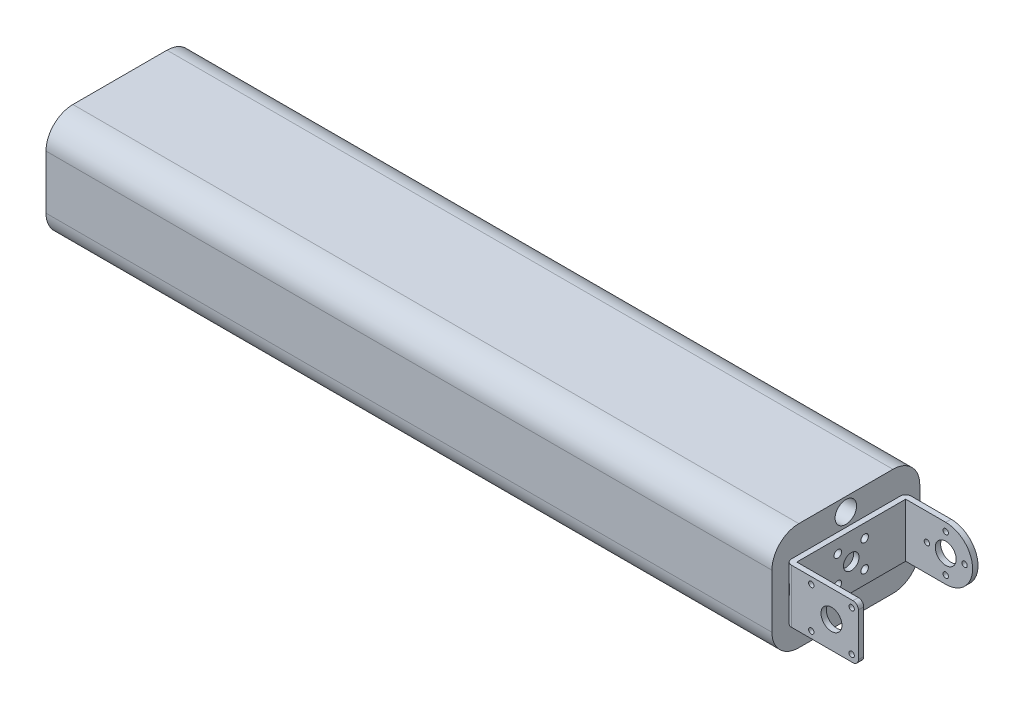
ISO-10303-21;
HEADER;
FILE_DESCRIPTION(('STEP AP214'),'2;1');
FILE_NAME('part.step','',(''),(''),'','','');
FILE_SCHEMA(('AUTOMOTIVE_DESIGN { 1 0 10303 214 1 1 1 1 }'));
ENDSEC;
DATA;
#1=APPLICATION_CONTEXT('core data for automotive mechanical design processes');
#2=APPLICATION_PROTOCOL_DEFINITION('international standard','automotive_design',2000,#1);
#3=PRODUCT_CONTEXT('',#1,'mechanical');
#4=PRODUCT('Part','Part','',(#3));
#5=PRODUCT_RELATED_PRODUCT_CATEGORY('part','',(#4));
#6=PRODUCT_DEFINITION_FORMATION('','',#4);
#7=PRODUCT_DEFINITION_CONTEXT('part definition',#1,'design');
#8=PRODUCT_DEFINITION('design','',#6,#7);
#9=PRODUCT_DEFINITION_SHAPE('','',#8);
#10=(LENGTH_UNIT() NAMED_UNIT(*) SI_UNIT(.MILLI.,.METRE.));
#11=(NAMED_UNIT(*) PLANE_ANGLE_UNIT() SI_UNIT($,.RADIAN.));
#12=(NAMED_UNIT(*) SI_UNIT($,.STERADIAN.) SOLID_ANGLE_UNIT());
#13=UNCERTAINTY_MEASURE_WITH_UNIT(LENGTH_MEASURE(1.E-05),#10,'distance_accuracy_value','');
#14=(GEOMETRIC_REPRESENTATION_CONTEXT(3) GLOBAL_UNCERTAINTY_ASSIGNED_CONTEXT((#13)) GLOBAL_UNIT_ASSIGNED_CONTEXT((#10,
#11,#12)) REPRESENTATION_CONTEXT('',''));
#15=CARTESIAN_POINT('',(0.,0.,0.));
#16=DIRECTION('',(0.,0.,1.));
#17=DIRECTION('',(1.,0.,0.));
#18=AXIS2_PLACEMENT_3D('',#15,#16,#17);
#19=CARTESIAN_POINT('',(-13.45,0.,0.));
#20=DIRECTION('',(0.,1.,0.));
#21=DIRECTION('',(0.,0.,1.));
#22=AXIS2_PLACEMENT_3D('',#19,#20,#21);
#23=PLANE('',#22);
#24=CARTESIAN_POINT('',(-24.9,0.,20.25));
#25=DIRECTION('',(0.,1.,0.));
#26=DIRECTION('',(-0.707106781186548,0.,0.707106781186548));
#27=AXIS2_PLACEMENT_3D('',#24,#25,#26);
#28=CIRCLE('',#27,2.);
#29=CARTESIAN_POINT('',(-26.9,0.,20.25));
#30=VERTEX_POINT('',#29);
#31=CARTESIAN_POINT('',(-24.9,0.,22.25));
#32=VERTEX_POINT('',#31);
#33=EDGE_CURVE('E351',#30,#32,#28,.T.);
#34=ORIENTED_EDGE('',*,*,#33,.F.);
#35=DIRECTION('',(0.,0.,-1.));
#36=VECTOR('',#35,1.);
#37=CARTESIAN_POINT('',(-26.9,0.,22.25));
#38=LINE('',#37,#36);
#39=CARTESIAN_POINT('',(-26.9,0.,-20.25));
#40=VERTEX_POINT('',#39);
#41=EDGE_CURVE('E339',#30,#40,#38,.T.);
#42=ORIENTED_EDGE('',*,*,#41,.T.);
#43=CARTESIAN_POINT('',(-24.9,0.,-20.25));
#44=DIRECTION('',(0.,1.,0.));
#45=DIRECTION('',(-0.707106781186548,0.,-0.707106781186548));
#46=AXIS2_PLACEMENT_3D('',#43,#44,#45);
#47=CIRCLE('',#46,2.);
#48=CARTESIAN_POINT('',(-24.9,0.,-22.25));
#49=VERTEX_POINT('',#48);
#50=EDGE_CURVE('E439',#49,#40,#47,.T.);
#51=ORIENTED_EDGE('',*,*,#50,.F.);
#52=DIRECTION('',(1.,0.,0.));
#53=VECTOR('',#52,1.);
#54=CARTESIAN_POINT('',(-26.9,0.,-22.25));
#55=LINE('',#54,#53);
#56=CARTESIAN_POINT('',(-10.,0.,-22.25));
#57=VERTEX_POINT('',#56);
#58=EDGE_CURVE('E441',#49,#57,#55,.T.);
#59=ORIENTED_EDGE('',*,*,#58,.T.);
#60=DIRECTION('',(0.,0.,-1.));
#61=VECTOR('',#60,1.);
#62=CARTESIAN_POINT('',(-10.,0.,-22.25));
#63=LINE('',#62,#61);
#64=CARTESIAN_POINT('',(-10.,0.,-20.25));
#65=VERTEX_POINT('',#64);
#66=EDGE_CURVE('E583',#65,#57,#63,.T.);
#67=ORIENTED_EDGE('',*,*,#66,.F.);
#68=DIRECTION('',(1.,0.,0.));
#69=VECTOR('',#68,1.);
#70=CARTESIAN_POINT('',(-24.9,0.,-20.25));
#71=LINE('',#70,#69);
#72=CARTESIAN_POINT('',(-24.9,0.,-20.25));
#73=VERTEX_POINT('',#72);
#74=EDGE_CURVE('E468',#73,#65,#71,.T.);
#75=ORIENTED_EDGE('',*,*,#74,.F.);
#76=DIRECTION('',(0.,0.,-1.));
#77=VECTOR('',#76,1.);
#78=CARTESIAN_POINT('',(-24.9,0.,20.25));
#79=LINE('',#78,#77);
#80=CARTESIAN_POINT('',(-24.9,0.,20.25));
#81=VERTEX_POINT('',#80);
#82=EDGE_CURVE('E467',#81,#73,#79,.T.);
#83=ORIENTED_EDGE('',*,*,#82,.F.);
#84=DIRECTION('',(-1.,0.,0.));
#85=VECTOR('',#84,1.);
#86=CARTESIAN_POINT('',(0.,0.,20.25));
#87=LINE('',#86,#85);
#88=CARTESIAN_POINT('',(-2.,0.,20.25));
#89=VERTEX_POINT('',#88);
#90=EDGE_CURVE('E488',#89,#81,#87,.T.);
#91=ORIENTED_EDGE('',*,*,#90,.F.);
#92=DIRECTION('',(0.,0.,-1.));
#93=VECTOR('',#92,1.);
#94=CARTESIAN_POINT('',(-2.,0.,11.125));
#95=LINE('',#94,#93);
#96=CARTESIAN_POINT('',(-2.,0.,22.25));
#97=VERTEX_POINT('',#96);
#98=EDGE_CURVE('E460',#97,#89,#95,.T.);
#99=ORIENTED_EDGE('',*,*,#98,.F.);
#100=DIRECTION('',(-1.,0.,0.));
#101=VECTOR('',#100,1.);
#102=CARTESIAN_POINT('',(0.,0.,22.25));
#103=LINE('',#102,#101);
#104=EDGE_CURVE('E358',#97,#32,#103,.T.);
#105=ORIENTED_EDGE('',*,*,#104,.T.);
#106=EDGE_LOOP('',(#34,#42,#51,#59,#67,#75,#83,#91,#99,#105));
#107=FACE_BOUND('',#106,.T.);
#108=ADVANCED_FACE('F52',(#107),#23,.F.);
#109=CARTESIAN_POINT('',(-24.9,0.,20.25));
#110=DIRECTION('',(1.,0.,0.));
#111=DIRECTION('',(0.,-1.,0.));
#112=AXIS2_PLACEMENT_3D('',#109,#110,#111);
#113=PLANE('',#112);
#114=CARTESIAN_POINT('',(-24.9,5.,5.));
#115=DIRECTION('',(-1.,0.,0.));
#116=DIRECTION('',(0.,0.,1.));
#117=AXIS2_PLACEMENT_3D('',#114,#115,#116);
#118=CIRCLE('',#117,1.4);
#119=CARTESIAN_POINT('',(-24.9,5.,3.6));
#120=VERTEX_POINT('',#119);
#121=EDGE_CURVE('E548',#120,#120,#118,.T.);
#122=ORIENTED_EDGE('',*,*,#121,.T.);
#123=EDGE_LOOP('',(#122));
#124=FACE_BOUND('',#123,.T.);
#125=CARTESIAN_POINT('',(-24.9,10.,0.));
#126=DIRECTION('',(-1.,0.,0.));
#127=DIRECTION('',(0.,0.,1.));
#128=AXIS2_PLACEMENT_3D('',#125,#126,#127);
#129=CIRCLE('',#128,2.9);
#130=CARTESIAN_POINT('',(-24.9,10.,-2.9));
#131=VERTEX_POINT('',#130);
#132=EDGE_CURVE('E547',#131,#131,#129,.T.);
#133=ORIENTED_EDGE('',*,*,#132,.T.);
#134=EDGE_LOOP('',(#133));
#135=FACE_BOUND('',#134,.T.);
#136=CARTESIAN_POINT('',(-24.9,15.,5.));
#137=DIRECTION('',(-1.,0.,0.));
#138=DIRECTION('',(0.,0.,1.));
#139=AXIS2_PLACEMENT_3D('',#136,#137,#138);
#140=CIRCLE('',#139,1.4);
#141=CARTESIAN_POINT('',(-24.9,15.,3.6));
#142=VERTEX_POINT('',#141);
#143=EDGE_CURVE('E538',#142,#142,#140,.T.);
#144=ORIENTED_EDGE('',*,*,#143,.T.);
#145=EDGE_LOOP('',(#144));
#146=FACE_BOUND('',#145,.T.);
#147=CARTESIAN_POINT('',(-24.9,5.,-5.));
#148=DIRECTION('',(-1.,0.,0.));
#149=DIRECTION('',(0.,0.,1.));
#150=AXIS2_PLACEMENT_3D('',#147,#148,#149);
#151=CIRCLE('',#150,1.4);
#152=CARTESIAN_POINT('',(-24.9,5.,-6.4));
#153=VERTEX_POINT('',#152);
#154=EDGE_CURVE('E523',#153,#153,#151,.T.);
#155=ORIENTED_EDGE('',*,*,#154,.T.);
#156=EDGE_LOOP('',(#155));
#157=FACE_BOUND('',#156,.T.);
#158=CARTESIAN_POINT('',(-24.9,15.,-5.));
#159=DIRECTION('',(-1.,0.,0.));
#160=DIRECTION('',(0.,0.,1.));
#161=AXIS2_PLACEMENT_3D('',#158,#159,#160);
#162=CIRCLE('',#161,1.4);
#163=CARTESIAN_POINT('',(-24.9,15.,-6.4));
#164=VERTEX_POINT('',#163);
#165=EDGE_CURVE('E536',#164,#164,#162,.T.);
#166=ORIENTED_EDGE('',*,*,#165,.T.);
#167=EDGE_LOOP('',(#166));
#168=FACE_BOUND('',#167,.T.);
#169=ORIENTED_EDGE('',*,*,#82,.T.);
#170=DIRECTION('',(0.,1.,0.));
#171=VECTOR('',#170,1.);
#172=CARTESIAN_POINT('',(-24.9,0.,-20.25));
#173=LINE('',#172,#171);
#174=CARTESIAN_POINT('',(-24.9,20.,-20.25));
#175=VERTEX_POINT('',#174);
#176=EDGE_CURVE('E617',#73,#175,#173,.T.);
#177=ORIENTED_EDGE('',*,*,#176,.T.);
#178=DIRECTION('',(0.,0.,-1.));
#179=VECTOR('',#178,1.);
#180=CARTESIAN_POINT('',(-24.9,20.,20.25));
#181=LINE('',#180,#179);
#182=CARTESIAN_POINT('',(-24.9,20.,20.25));
#183=VERTEX_POINT('',#182);
#184=EDGE_CURVE('E384',#183,#175,#181,.T.);
#185=ORIENTED_EDGE('',*,*,#184,.F.);
#186=DIRECTION('',(0.,1.,0.));
#187=VECTOR('',#186,1.);
#188=CARTESIAN_POINT('',(-24.9,0.,20.25));
#189=LINE('',#188,#187);
#190=EDGE_CURVE('E489',#81,#183,#189,.T.);
#191=ORIENTED_EDGE('',*,*,#190,.F.);
#192=EDGE_LOOP('',(#169,#177,#185,#191));
#193=FACE_BOUND('',#192,.T.);
#194=ADVANCED_FACE('F686',(#124,#135,#146,#157,#168,#193),#113,.T.);
#195=CARTESIAN_POINT('',(-24.9,0.,-20.25));
#196=DIRECTION('',(0.,0.,1.));
#197=DIRECTION('',(0.,1.,0.));
#198=AXIS2_PLACEMENT_3D('',#195,#196,#197);
#199=PLANE('',#198);
#200=CARTESIAN_POINT('',(-10.,17.,-20.25));
#201=DIRECTION('',(0.,0.,-1.));
#202=DIRECTION('',(-1.,0.,0.));
#203=AXIS2_PLACEMENT_3D('',#200,#201,#202);
#204=CIRCLE('',#203,1.);
#205=CARTESIAN_POINT('',(-9.,17.,-20.25));
#206=VERTEX_POINT('',#205);
#207=EDGE_CURVE('E434',#206,#206,#204,.T.);
#208=ORIENTED_EDGE('',*,*,#207,.T.);
#209=EDGE_LOOP('',(#208));
#210=FACE_BOUND('',#209,.T.);
#211=CARTESIAN_POINT('',(-10.,10.,-20.25));
#212=DIRECTION('',(0.,0.,-1.));
#213=DIRECTION('',(-1.,0.,0.));
#214=AXIS2_PLACEMENT_3D('',#211,#212,#213);
#215=CIRCLE('',#214,3.9);
#216=CARTESIAN_POINT('',(-6.1,10.,-20.25));
#217=VERTEX_POINT('',#216);
#218=EDGE_CURVE('E596',#217,#217,#215,.T.);
#219=ORIENTED_EDGE('',*,*,#218,.T.);
#220=EDGE_LOOP('',(#219));
#221=FACE_BOUND('',#220,.T.);
#222=CARTESIAN_POINT('',(-17.,10.,-20.25));
#223=DIRECTION('',(0.,0.,-1.));
#224=DIRECTION('',(-1.,0.,0.));
#225=AXIS2_PLACEMENT_3D('',#222,#223,#224);
#226=CIRCLE('',#225,1.);
#227=CARTESIAN_POINT('',(-16.,10.,-20.25));
#228=VERTEX_POINT('',#227);
#229=EDGE_CURVE('E455',#228,#228,#226,.T.);
#230=ORIENTED_EDGE('',*,*,#229,.T.);
#231=EDGE_LOOP('',(#230));
#232=FACE_BOUND('',#231,.T.);
#233=CARTESIAN_POINT('',(-3.,10.,-20.25));
#234=DIRECTION('',(0.,0.,-1.));
#235=DIRECTION('',(-1.,0.,0.));
#236=AXIS2_PLACEMENT_3D('',#233,#234,#235);
#237=CIRCLE('',#236,1.);
#238=CARTESIAN_POINT('',(-2.,10.,-20.25));
#239=VERTEX_POINT('',#238);
#240=EDGE_CURVE('E575',#239,#239,#237,.T.);
#241=ORIENTED_EDGE('',*,*,#240,.T.);
#242=EDGE_LOOP('',(#241));
#243=FACE_BOUND('',#242,.T.);
#244=CARTESIAN_POINT('',(-10.,3.,-20.25));
#245=DIRECTION('',(0.,0.,-1.));
#246=DIRECTION('',(-1.,0.,0.));
#247=AXIS2_PLACEMENT_3D('',#244,#245,#246);
#248=CIRCLE('',#247,1.);
#249=CARTESIAN_POINT('',(-9.,3.,-20.25));
#250=VERTEX_POINT('',#249);
#251=EDGE_CURVE('E561',#250,#250,#248,.T.);
#252=ORIENTED_EDGE('',*,*,#251,.T.);
#253=EDGE_LOOP('',(#252));
#254=FACE_BOUND('',#253,.T.);
#255=CARTESIAN_POINT('',(-10.,10.,-20.25));
#256=DIRECTION('',(0.,0.,1.));
#257=DIRECTION('',(-1.,0.,0.));
#258=AXIS2_PLACEMENT_3D('',#255,#256,#257);
#259=CIRCLE('',#258,10.);
#260=CARTESIAN_POINT('',(-10.,20.,-20.25));
#261=VERTEX_POINT('',#260);
#262=EDGE_CURVE('E581',#65,#261,#259,.T.);
#263=ORIENTED_EDGE('',*,*,#262,.T.);
#264=DIRECTION('',(1.,0.,0.));
#265=VECTOR('',#264,1.);
#266=CARTESIAN_POINT('',(-24.9,20.,-20.25));
#267=LINE('',#266,#265);
#268=EDGE_CURVE('E401',#175,#261,#267,.T.);
#269=ORIENTED_EDGE('',*,*,#268,.F.);
#270=ORIENTED_EDGE('',*,*,#176,.F.);
#271=ORIENTED_EDGE('',*,*,#74,.T.);
#272=EDGE_LOOP('',(#263,#269,#270,#271));
#273=FACE_BOUND('',#272,.T.);
#274=ADVANCED_FACE('F691',(#210,#221,#232,#243,#254,#273),#199,.T.);
#275=CARTESIAN_POINT('',(-26.9,0.,22.25));
#276=DIRECTION('',(0.,0.,1.));
#277=DIRECTION('',(0.,1.,0.));
#278=AXIS2_PLACEMENT_3D('',#275,#276,#277);
#279=PLANE('',#278);
#280=CARTESIAN_POINT('',(-17.5,17.5,22.25));
#281=DIRECTION('',(0.,0.,-1.));
#282=DIRECTION('',(1.,0.,0.));
#283=AXIS2_PLACEMENT_3D('',#280,#281,#282);
#284=CIRCLE('',#283,1.);
#285=CARTESIAN_POINT('',(-18.5,17.5,22.25));
#286=VERTEX_POINT('',#285);
#287=EDGE_CURVE('E377',#286,#286,#284,.T.);
#288=ORIENTED_EDGE('',*,*,#287,.T.);
#289=EDGE_LOOP('',(#288));
#290=FACE_BOUND('',#289,.T.);
#291=CARTESIAN_POINT('',(-10.,10.,22.25));
#292=DIRECTION('',(0.,0.,-1.));
#293=DIRECTION('',(1.,0.,0.));
#294=AXIS2_PLACEMENT_3D('',#291,#292,#293);
#295=CIRCLE('',#294,3.9);
#296=CARTESIAN_POINT('',(-13.9,10.,22.25));
#297=VERTEX_POINT('',#296);
#298=EDGE_CURVE('E413',#297,#297,#295,.T.);
#299=ORIENTED_EDGE('',*,*,#298,.T.);
#300=EDGE_LOOP('',(#299));
#301=FACE_BOUND('',#300,.T.);
#302=CARTESIAN_POINT('',(-2.5,17.5,22.25));
#303=DIRECTION('',(0.,0.,-1.));
#304=DIRECTION('',(1.,0.,0.));
#305=AXIS2_PLACEMENT_3D('',#302,#303,#304);
#306=CIRCLE('',#305,1.);
#307=CARTESIAN_POINT('',(-3.5,17.5,22.25));
#308=VERTEX_POINT('',#307);
#309=EDGE_CURVE('E412',#308,#308,#306,.T.);
#310=ORIENTED_EDGE('',*,*,#309,.T.);
#311=EDGE_LOOP('',(#310));
#312=FACE_BOUND('',#311,.T.);
#313=CARTESIAN_POINT('',(-17.5,2.5,22.25));
#314=DIRECTION('',(0.,0.,-1.));
#315=DIRECTION('',(1.,0.,0.));
#316=AXIS2_PLACEMENT_3D('',#313,#314,#315);
#317=CIRCLE('',#316,1.);
#318=CARTESIAN_POINT('',(-18.5,2.5,22.25));
#319=VERTEX_POINT('',#318);
#320=EDGE_CURVE('E389',#319,#319,#317,.T.);
#321=ORIENTED_EDGE('',*,*,#320,.T.);
#322=EDGE_LOOP('',(#321));
#323=FACE_BOUND('',#322,.T.);
#324=CARTESIAN_POINT('',(-2.5,2.5,22.25));
#325=DIRECTION('',(0.,0.,-1.));
#326=DIRECTION('',(1.,0.,0.));
#327=AXIS2_PLACEMENT_3D('',#324,#325,#326);
#328=CIRCLE('',#327,1.);
#329=CARTESIAN_POINT('',(-3.5,2.5,22.25));
#330=VERTEX_POINT('',#329);
#331=EDGE_CURVE('E443',#330,#330,#328,.T.);
#332=ORIENTED_EDGE('',*,*,#331,.T.);
#333=EDGE_LOOP('',(#332));
#334=FACE_BOUND('',#333,.T.);
#335=DIRECTION('',(0.,1.,0.));
#336=VECTOR('',#335,1.);
#337=CARTESIAN_POINT('',(-24.9,0.,22.25));
#338=LINE('',#337,#336);
#339=CARTESIAN_POINT('',(-24.9,20.,22.25));
#340=VERTEX_POINT('',#339);
#341=EDGE_CURVE('E363',#32,#340,#338,.T.);
#342=ORIENTED_EDGE('',*,*,#341,.F.);
#343=ORIENTED_EDGE('',*,*,#104,.F.);
#344=CARTESIAN_POINT('',(-2.,2.,22.25));
#345=DIRECTION('',(0.,0.,-1.));
#346=DIRECTION('',(0.707106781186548,-0.707106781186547,0.));
#347=AXIS2_PLACEMENT_3D('',#344,#345,#346);
#348=CIRCLE('',#347,2.);
#349=CARTESIAN_POINT('',(0.,2.,22.25));
#350=VERTEX_POINT('',#349);
#351=EDGE_CURVE('E450',#350,#97,#348,.T.);
#352=ORIENTED_EDGE('',*,*,#351,.F.);
#353=DIRECTION('',(0.,1.,0.));
#354=VECTOR('',#353,1.);
#355=CARTESIAN_POINT('',(0.,0.,22.25));
#356=LINE('',#355,#354);
#357=CARTESIAN_POINT('',(0.,18.,22.25));
#358=VERTEX_POINT('',#357);
#359=EDGE_CURVE('E477',#350,#358,#356,.T.);
#360=ORIENTED_EDGE('',*,*,#359,.T.);
#361=CARTESIAN_POINT('',(-2.,18.,22.25));
#362=DIRECTION('',(0.,0.,-1.));
#363=DIRECTION('',(0.707106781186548,0.707106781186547,0.));
#364=AXIS2_PLACEMENT_3D('',#361,#362,#363);
#365=CIRCLE('',#364,2.);
#366=CARTESIAN_POINT('',(-2.,20.,22.25));
#367=VERTEX_POINT('',#366);
#368=EDGE_CURVE('E525',#367,#358,#365,.T.);
#369=ORIENTED_EDGE('',*,*,#368,.F.);
#370=DIRECTION('',(1.,0.,0.));
#371=VECTOR('',#370,1.);
#372=CARTESIAN_POINT('',(0.,20.,22.25));
#373=LINE('',#372,#371);
#374=EDGE_CURVE('E396',#340,#367,#373,.T.);
#375=ORIENTED_EDGE('',*,*,#374,.F.);
#376=EDGE_LOOP('',(#342,#343,#352,#360,#369,#375));
#377=FACE_BOUND('',#376,.T.);
#378=ADVANCED_FACE('F714',(#290,#301,#312,#323,#334,#377),#279,.T.);
#379=CARTESIAN_POINT('',(-17.5,17.5,22.25));
#380=DIRECTION('',(0.,0.,-1.));
#381=DIRECTION('',(1.,0.,0.));
#382=AXIS2_PLACEMENT_3D('',#379,#380,#381);
#383=CYLINDRICAL_SURFACE('',#382,1.);
#384=ORIENTED_EDGE('',*,*,#287,.F.);
#385=DIRECTION('',(0.,0.,-1.));
#386=VECTOR('',#385,1.);
#387=CARTESIAN_POINT('',(-18.5,17.5,22.25));
#388=LINE('',#387,#386);
#389=CARTESIAN_POINT('',(-18.5,17.5,20.25));
#390=VERTEX_POINT('',#389);
#391=EDGE_CURVE('E374',#286,#390,#388,.T.);
#392=ORIENTED_EDGE('',*,*,#391,.T.);
#393=CARTESIAN_POINT('',(-17.5,17.5,20.25));
#394=DIRECTION('',(0.,0.,1.));
#395=DIRECTION('',(1.,0.,0.));
#396=AXIS2_PLACEMENT_3D('',#393,#394,#395);
#397=CIRCLE('',#396,1.);
#398=EDGE_CURVE('E517',#390,#390,#397,.T.);
#399=ORIENTED_EDGE('',*,*,#398,.F.);
#400=ORIENTED_EDGE('',*,*,#391,.F.);
#401=EDGE_LOOP('',(#384,#392,#399,#400));
#402=FACE_BOUND('',#401,.T.);
#403=ADVANCED_FACE('F918',(#402),#383,.F.);
#404=CARTESIAN_POINT('',(-10.,10.,22.25));
#405=DIRECTION('',(0.,0.,-1.));
#406=DIRECTION('',(1.,0.,0.));
#407=AXIS2_PLACEMENT_3D('',#404,#405,#406);
#408=CYLINDRICAL_SURFACE('',#407,3.9);
#409=ORIENTED_EDGE('',*,*,#298,.F.);
#410=DIRECTION('',(0.,0.,-1.));
#411=VECTOR('',#410,1.);
#412=CARTESIAN_POINT('',(-13.9,10.,22.25));
#413=LINE('',#412,#411);
#414=CARTESIAN_POINT('',(-13.9,10.,20.25));
#415=VERTEX_POINT('',#414);
#416=EDGE_CURVE('E607',#297,#415,#413,.T.);
#417=ORIENTED_EDGE('',*,*,#416,.T.);
#418=CARTESIAN_POINT('',(-10.,10.,20.25));
#419=DIRECTION('',(0.,0.,1.));
#420=DIRECTION('',(1.,0.,0.));
#421=AXIS2_PLACEMENT_3D('',#418,#419,#420);
#422=CIRCLE('',#421,3.9);
#423=EDGE_CURVE('E511',#415,#415,#422,.T.);
#424=ORIENTED_EDGE('',*,*,#423,.F.);
#425=ORIENTED_EDGE('',*,*,#416,.F.);
#426=EDGE_LOOP('',(#409,#417,#424,#425));
#427=FACE_BOUND('',#426,.T.);
#428=ADVANCED_FACE('F917',(#427),#408,.F.);
#429=CARTESIAN_POINT('',(-2.5,17.5,22.25));
#430=DIRECTION('',(0.,0.,-1.));
#431=DIRECTION('',(1.,0.,0.));
#432=AXIS2_PLACEMENT_3D('',#429,#430,#431);
#433=CYLINDRICAL_SURFACE('',#432,1.);
#434=ORIENTED_EDGE('',*,*,#309,.F.);
#435=DIRECTION('',(0.,0.,-1.));
#436=VECTOR('',#435,1.);
#437=CARTESIAN_POINT('',(-3.5,17.5,22.25));
#438=LINE('',#437,#436);
#439=CARTESIAN_POINT('',(-3.5,17.5,20.25));
#440=VERTEX_POINT('',#439);
#441=EDGE_CURVE('E409',#308,#440,#438,.T.);
#442=ORIENTED_EDGE('',*,*,#441,.T.);
#443=CARTESIAN_POINT('',(-2.5,17.5,20.25));
#444=DIRECTION('',(0.,0.,1.));
#445=DIRECTION('',(1.,0.,0.));
#446=AXIS2_PLACEMENT_3D('',#443,#444,#445);
#447=CIRCLE('',#446,1.);
#448=EDGE_CURVE('E509',#440,#440,#447,.T.);
#449=ORIENTED_EDGE('',*,*,#448,.F.);
#450=ORIENTED_EDGE('',*,*,#441,.F.);
#451=EDGE_LOOP('',(#434,#442,#449,#450));
#452=FACE_BOUND('',#451,.T.);
#453=ADVANCED_FACE('F916',(#452),#433,.F.);
#454=CARTESIAN_POINT('',(-17.5,2.5,22.25));
#455=DIRECTION('',(0.,0.,-1.));
#456=DIRECTION('',(1.,0.,0.));
#457=AXIS2_PLACEMENT_3D('',#454,#455,#456);
#458=CYLINDRICAL_SURFACE('',#457,1.);
#459=ORIENTED_EDGE('',*,*,#320,.F.);
#460=DIRECTION('',(0.,0.,-1.));
#461=VECTOR('',#460,1.);
#462=CARTESIAN_POINT('',(-18.5,2.5,22.25));
#463=LINE('',#462,#461);
#464=CARTESIAN_POINT('',(-18.5,2.5,20.25));
#465=VERTEX_POINT('',#464);
#466=EDGE_CURVE('E392',#319,#465,#463,.T.);
#467=ORIENTED_EDGE('',*,*,#466,.T.);
#468=CARTESIAN_POINT('',(-17.5,2.5,20.25));
#469=DIRECTION('',(0.,0.,1.));
#470=DIRECTION('',(1.,0.,0.));
#471=AXIS2_PLACEMENT_3D('',#468,#469,#470);
#472=CIRCLE('',#471,1.);
#473=EDGE_CURVE('E503',#465,#465,#472,.T.);
#474=ORIENTED_EDGE('',*,*,#473,.F.);
#475=ORIENTED_EDGE('',*,*,#466,.F.);
#476=EDGE_LOOP('',(#459,#467,#474,#475));
#477=FACE_BOUND('',#476,.T.);
#478=ADVANCED_FACE('F958',(#477),#458,.F.);
#479=CARTESIAN_POINT('',(-2.5,2.5,22.25));
#480=DIRECTION('',(0.,0.,-1.));
#481=DIRECTION('',(1.,0.,0.));
#482=AXIS2_PLACEMENT_3D('',#479,#480,#481);
#483=CYLINDRICAL_SURFACE('',#482,1.);
#484=ORIENTED_EDGE('',*,*,#331,.F.);
#485=DIRECTION('',(0.,0.,-1.));
#486=VECTOR('',#485,1.);
#487=CARTESIAN_POINT('',(-3.5,2.5,22.25));
#488=LINE('',#487,#486);
#489=CARTESIAN_POINT('',(-3.5,2.5,20.25));
#490=VERTEX_POINT('',#489);
#491=EDGE_CURVE('E394',#330,#490,#488,.T.);
#492=ORIENTED_EDGE('',*,*,#491,.T.);
#493=CARTESIAN_POINT('',(-2.5,2.5,20.25));
#494=DIRECTION('',(0.,0.,1.));
#495=DIRECTION('',(1.,0.,0.));
#496=AXIS2_PLACEMENT_3D('',#493,#494,#495);
#497=CIRCLE('',#496,1.);
#498=EDGE_CURVE('E497',#490,#490,#497,.T.);
#499=ORIENTED_EDGE('',*,*,#498,.F.);
#500=ORIENTED_EDGE('',*,*,#491,.F.);
#501=EDGE_LOOP('',(#484,#492,#499,#500));
#502=FACE_BOUND('',#501,.T.);
#503=ADVANCED_FACE('F954',(#502),#483,.F.);
#504=CARTESIAN_POINT('',(0.,0.,-22.25));
#505=DIRECTION('',(0.,0.,-1.));
#506=DIRECTION('',(-1.,0.,0.));
#507=AXIS2_PLACEMENT_3D('',#504,#505,#506);
#508=PLANE('',#507);
#509=CARTESIAN_POINT('',(-10.,3.,-22.25));
#510=DIRECTION('',(0.,0.,1.));
#511=DIRECTION('',(-1.,0.,0.));
#512=AXIS2_PLACEMENT_3D('',#509,#510,#511);
#513=CIRCLE('',#512,1.);
#514=CARTESIAN_POINT('',(-9.,3.,-22.25));
#515=VERTEX_POINT('',#514);
#516=EDGE_CURVE('E551',#515,#515,#513,.T.);
#517=ORIENTED_EDGE('',*,*,#516,.T.);
#518=EDGE_LOOP('',(#517));
#519=FACE_BOUND('',#518,.T.);
#520=CARTESIAN_POINT('',(-3.,10.,-22.25));
#521=DIRECTION('',(0.,0.,1.));
#522=DIRECTION('',(-1.,0.,0.));
#523=AXIS2_PLACEMENT_3D('',#520,#521,#522);
#524=CIRCLE('',#523,1.);
#525=CARTESIAN_POINT('',(-2.,10.,-22.25));
#526=VERTEX_POINT('',#525);
#527=EDGE_CURVE('E562',#526,#526,#524,.T.);
#528=ORIENTED_EDGE('',*,*,#527,.T.);
#529=EDGE_LOOP('',(#528));
#530=FACE_BOUND('',#529,.T.);
#531=CARTESIAN_POINT('',(-17.,10.,-22.25));
#532=DIRECTION('',(0.,0.,1.));
#533=DIRECTION('',(-1.,0.,0.));
#534=AXIS2_PLACEMENT_3D('',#531,#532,#533);
#535=CIRCLE('',#534,1.);
#536=CARTESIAN_POINT('',(-16.,10.,-22.25));
#537=VERTEX_POINT('',#536);
#538=EDGE_CURVE('E452',#537,#537,#535,.T.);
#539=ORIENTED_EDGE('',*,*,#538,.T.);
#540=EDGE_LOOP('',(#539));
#541=FACE_BOUND('',#540,.T.);
#542=CARTESIAN_POINT('',(-10.,10.,-22.25));
#543=DIRECTION('',(0.,0.,1.));
#544=DIRECTION('',(-1.,0.,0.));
#545=AXIS2_PLACEMENT_3D('',#542,#543,#544);
#546=CIRCLE('',#545,3.9);
#547=CARTESIAN_POINT('',(-6.1,10.,-22.25));
#548=VERTEX_POINT('',#547);
#549=EDGE_CURVE('E532',#548,#548,#546,.T.);
#550=ORIENTED_EDGE('',*,*,#549,.T.);
#551=EDGE_LOOP('',(#550));
#552=FACE_BOUND('',#551,.T.);
#553=CARTESIAN_POINT('',(-10.,17.,-22.25));
#554=DIRECTION('',(0.,0.,1.));
#555=DIRECTION('',(-1.,0.,0.));
#556=AXIS2_PLACEMENT_3D('',#553,#554,#555);
#557=CIRCLE('',#556,1.);
#558=CARTESIAN_POINT('',(-9.,17.,-22.25));
#559=VERTEX_POINT('',#558);
#560=EDGE_CURVE('E436',#559,#559,#557,.T.);
#561=ORIENTED_EDGE('',*,*,#560,.T.);
#562=EDGE_LOOP('',(#561));
#563=FACE_BOUND('',#562,.T.);
#564=DIRECTION('',(0.,-1.,0.));
#565=VECTOR('',#564,1.);
#566=CARTESIAN_POINT('',(-24.9,0.,-22.25));
#567=LINE('',#566,#565);
#568=CARTESIAN_POINT('',(-24.9,20.,-22.25));
#569=VERTEX_POINT('',#568);
#570=EDGE_CURVE('E427',#569,#49,#567,.T.);
#571=ORIENTED_EDGE('',*,*,#570,.F.);
#572=DIRECTION('',(-1.,0.,0.));
#573=VECTOR('',#572,1.);
#574=CARTESIAN_POINT('',(-26.9,20.,-22.25));
#575=LINE('',#574,#573);
#576=CARTESIAN_POINT('',(-10.,20.,-22.25));
#577=VERTEX_POINT('',#576);
#578=EDGE_CURVE('E422',#577,#569,#575,.T.);
#579=ORIENTED_EDGE('',*,*,#578,.F.);
#580=CARTESIAN_POINT('',(-10.,10.,-22.25));
#581=DIRECTION('',(0.,0.,-1.));
#582=DIRECTION('',(-1.,0.,0.));
#583=AXIS2_PLACEMENT_3D('',#580,#581,#582);
#584=CIRCLE('',#583,10.);
#585=EDGE_CURVE('E580',#577,#57,#584,.T.);
#586=ORIENTED_EDGE('',*,*,#585,.T.);
#587=ORIENTED_EDGE('',*,*,#58,.F.);
#588=EDGE_LOOP('',(#571,#579,#586,#587));
#589=FACE_BOUND('',#588,.T.);
#590=ADVANCED_FACE('F951',(#519,#530,#541,#552,#563,#589),#508,.T.);
#591=CARTESIAN_POINT('',(-10.,17.,-22.25));
#592=DIRECTION('',(0.,0.,1.));
#593=DIRECTION('',(-1.,0.,0.));
#594=AXIS2_PLACEMENT_3D('',#591,#592,#593);
#595=CYLINDRICAL_SURFACE('',#594,1.);
#596=ORIENTED_EDGE('',*,*,#560,.F.);
#597=DIRECTION('',(0.,0.,1.));
#598=VECTOR('',#597,1.);
#599=CARTESIAN_POINT('',(-9.,17.,-22.25));
#600=LINE('',#599,#598);
#601=EDGE_CURVE('E431',#559,#206,#600,.T.);
#602=ORIENTED_EDGE('',*,*,#601,.T.);
#603=ORIENTED_EDGE('',*,*,#207,.F.);
#604=ORIENTED_EDGE('',*,*,#601,.F.);
#605=EDGE_LOOP('',(#596,#602,#603,#604));
#606=FACE_BOUND('',#605,.T.);
#607=ADVANCED_FACE('F950',(#606),#595,.F.);
#608=CARTESIAN_POINT('',(-10.,10.,-22.25));
#609=DIRECTION('',(0.,0.,1.));
#610=DIRECTION('',(-1.,0.,0.));
#611=AXIS2_PLACEMENT_3D('',#608,#609,#610);
#612=CYLINDRICAL_SURFACE('',#611,3.9);
#613=ORIENTED_EDGE('',*,*,#549,.F.);
#614=DIRECTION('',(0.,0.,1.));
#615=VECTOR('',#614,1.);
#616=CARTESIAN_POINT('',(-6.1,10.,-22.25));
#617=LINE('',#616,#615);
#618=EDGE_CURVE('E533',#548,#217,#617,.T.);
#619=ORIENTED_EDGE('',*,*,#618,.T.);
#620=ORIENTED_EDGE('',*,*,#218,.F.);
#621=ORIENTED_EDGE('',*,*,#618,.F.);
#622=EDGE_LOOP('',(#613,#619,#620,#621));
#623=FACE_BOUND('',#622,.T.);
#624=ADVANCED_FACE('F941',(#623),#612,.F.);
#625=CARTESIAN_POINT('',(-17.,10.,-22.25));
#626=DIRECTION('',(0.,0.,1.));
#627=DIRECTION('',(-1.,0.,0.));
#628=AXIS2_PLACEMENT_3D('',#625,#626,#627);
#629=CYLINDRICAL_SURFACE('',#628,1.);
#630=ORIENTED_EDGE('',*,*,#538,.F.);
#631=DIRECTION('',(0.,0.,1.));
#632=VECTOR('',#631,1.);
#633=CARTESIAN_POINT('',(-16.,10.,-22.25));
#634=LINE('',#633,#632);
#635=EDGE_CURVE('E449',#537,#228,#634,.T.);
#636=ORIENTED_EDGE('',*,*,#635,.T.);
#637=ORIENTED_EDGE('',*,*,#229,.F.);
#638=ORIENTED_EDGE('',*,*,#635,.F.);
#639=EDGE_LOOP('',(#630,#636,#637,#638));
#640=FACE_BOUND('',#639,.T.);
#641=ADVANCED_FACE('F936',(#640),#629,.F.);
#642=CARTESIAN_POINT('',(-10.,10.,-22.25));
#643=DIRECTION('',(0.,0.,1.));
#644=DIRECTION('',(1.,0.,0.));
#645=AXIS2_PLACEMENT_3D('',#642,#643,#644);
#646=CYLINDRICAL_SURFACE('',#645,10.);
#647=ORIENTED_EDGE('',*,*,#585,.F.);
#648=DIRECTION('',(0.,0.,-1.));
#649=VECTOR('',#648,1.);
#650=CARTESIAN_POINT('',(-10.,20.,-22.25));
#651=LINE('',#650,#649);
#652=EDGE_CURVE('E419',#261,#577,#651,.T.);
#653=ORIENTED_EDGE('',*,*,#652,.F.);
#654=ORIENTED_EDGE('',*,*,#262,.F.);
#655=ORIENTED_EDGE('',*,*,#66,.T.);
#656=EDGE_LOOP('',(#647,#653,#654,#655));
#657=FACE_BOUND('',#656,.T.);
#658=ADVANCED_FACE('F901',(#657),#646,.T.);
#659=CARTESIAN_POINT('',(-3.,10.,-22.25));
#660=DIRECTION('',(0.,0.,1.));
#661=DIRECTION('',(-1.,0.,0.));
#662=AXIS2_PLACEMENT_3D('',#659,#660,#661);
#663=CYLINDRICAL_SURFACE('',#662,1.);
#664=ORIENTED_EDGE('',*,*,#527,.F.);
#665=DIRECTION('',(0.,0.,1.));
#666=VECTOR('',#665,1.);
#667=CARTESIAN_POINT('',(-2.,10.,-22.25));
#668=LINE('',#667,#666);
#669=EDGE_CURVE('E568',#526,#239,#668,.T.);
#670=ORIENTED_EDGE('',*,*,#669,.T.);
#671=ORIENTED_EDGE('',*,*,#240,.F.);
#672=ORIENTED_EDGE('',*,*,#669,.F.);
#673=EDGE_LOOP('',(#664,#670,#671,#672));
#674=FACE_BOUND('',#673,.T.);
#675=ADVANCED_FACE('F899',(#674),#663,.F.);
#676=CARTESIAN_POINT('',(-10.,3.,-22.25));
#677=DIRECTION('',(0.,0.,1.));
#678=DIRECTION('',(-1.,0.,0.));
#679=AXIS2_PLACEMENT_3D('',#676,#677,#678);
#680=CYLINDRICAL_SURFACE('',#679,1.);
#681=ORIENTED_EDGE('',*,*,#516,.F.);
#682=DIRECTION('',(0.,0.,1.));
#683=VECTOR('',#682,1.);
#684=CARTESIAN_POINT('',(-9.,3.,-22.25));
#685=LINE('',#684,#683);
#686=EDGE_CURVE('E560',#515,#250,#685,.T.);
#687=ORIENTED_EDGE('',*,*,#686,.T.);
#688=ORIENTED_EDGE('',*,*,#251,.F.);
#689=ORIENTED_EDGE('',*,*,#686,.F.);
#690=EDGE_LOOP('',(#681,#687,#688,#689));
#691=FACE_BOUND('',#690,.T.);
#692=ADVANCED_FACE('F896',(#691),#680,.F.);
#693=CARTESIAN_POINT('',(-26.9,5.,5.));
#694=DIRECTION('',(1.,0.,0.));
#695=DIRECTION('',(0.,0.,1.));
#696=AXIS2_PLACEMENT_3D('',#693,#694,#695);
#697=CYLINDRICAL_SURFACE('',#696,1.4);
#698=DIRECTION('',(1.,0.,0.));
#699=VECTOR('',#698,1.);
#700=CARTESIAN_POINT('',(-26.9,5.,3.6));
#701=LINE('',#700,#699);
#702=CARTESIAN_POINT('',(-26.9,5.,3.6));
#703=VERTEX_POINT('',#702);
#704=EDGE_CURVE('E546',#703,#120,#701,.T.);
#705=ORIENTED_EDGE('',*,*,#704,.F.);
#706=ORIENTED_EDGE('',*,*,#704,.T.);
#707=ORIENTED_EDGE('',*,*,#121,.F.);
#708=EDGE_LOOP('',(#705,#706,#707));
#709=FACE_BOUND('',#708,.T.);
#710=CARTESIAN_POINT('',(-30.9,5.,5.));
#711=DIRECTION('',(1.,0.,0.));
#712=DIRECTION('',(0.,0.,-1.));
#713=AXIS2_PLACEMENT_3D('',#710,#711,#712);
#714=CIRCLE('',#713,1.4);
#715=CARTESIAN_POINT('',(-30.9,5.,3.6));
#716=VERTEX_POINT('',#715);
#717=EDGE_CURVE('E780',#716,#716,#714,.T.);
#718=ORIENTED_EDGE('',*,*,#717,.F.);
#719=EDGE_LOOP('',(#718));
#720=FACE_BOUND('',#719,.T.);
#721=ADVANCED_FACE('F898',(#709,#720),#697,.F.);
#722=CARTESIAN_POINT('',(-26.9,10.,0.));
#723=DIRECTION('',(1.,0.,0.));
#724=DIRECTION('',(0.,0.,1.));
#725=AXIS2_PLACEMENT_3D('',#722,#723,#724);
#726=CYLINDRICAL_SURFACE('',#725,2.9);
#727=CARTESIAN_POINT('',(-26.9,10.,0.));
#728=DIRECTION('',(1.,0.,0.));
#729=DIRECTION('',(0.,0.,1.));
#730=AXIS2_PLACEMENT_3D('',#727,#728,#729);
#731=CIRCLE('',#730,2.9);
#732=CARTESIAN_POINT('',(-26.9,10.,-2.9));
#733=VERTEX_POINT('',#732);
#734=EDGE_CURVE('E352',#733,#733,#731,.T.);
#735=ORIENTED_EDGE('',*,*,#734,.F.);
#736=DIRECTION('',(1.,0.,0.));
#737=VECTOR('',#736,1.);
#738=CARTESIAN_POINT('',(-26.9,10.,-2.9));
#739=LINE('',#738,#737);
#740=EDGE_CURVE('E545',#733,#131,#739,.T.);
#741=ORIENTED_EDGE('',*,*,#740,.T.);
#742=ORIENTED_EDGE('',*,*,#132,.F.);
#743=ORIENTED_EDGE('',*,*,#740,.F.);
#744=EDGE_LOOP('',(#735,#741,#742,#743));
#745=FACE_BOUND('',#744,.T.);
#746=ADVANCED_FACE('F915',(#745),#726,.F.);
#747=CARTESIAN_POINT('',(-26.9,15.,5.));
#748=DIRECTION('',(1.,0.,0.));
#749=DIRECTION('',(0.,0.,1.));
#750=AXIS2_PLACEMENT_3D('',#747,#748,#749);
#751=CYLINDRICAL_SURFACE('',#750,1.4);
#752=DIRECTION('',(1.,0.,0.));
#753=VECTOR('',#752,1.);
#754=CARTESIAN_POINT('',(-26.9,15.,3.6));
#755=LINE('',#754,#753);
#756=CARTESIAN_POINT('',(-26.9,15.,3.6));
#757=VERTEX_POINT('',#756);
#758=EDGE_CURVE('E527',#757,#142,#755,.T.);
#759=ORIENTED_EDGE('',*,*,#758,.F.);
#760=ORIENTED_EDGE('',*,*,#758,.T.);
#761=ORIENTED_EDGE('',*,*,#143,.F.);
#762=EDGE_LOOP('',(#759,#760,#761));
#763=FACE_BOUND('',#762,.T.);
#764=CARTESIAN_POINT('',(-30.9,15.,5.));
#765=DIRECTION('',(1.,0.,0.));
#766=DIRECTION('',(0.,0.,-1.));
#767=AXIS2_PLACEMENT_3D('',#764,#765,#766);
#768=CIRCLE('',#767,1.4);
#769=CARTESIAN_POINT('',(-30.9,15.,3.6));
#770=VERTEX_POINT('',#769);
#771=EDGE_CURVE('E768',#770,#770,#768,.T.);
#772=ORIENTED_EDGE('',*,*,#771,.F.);
#773=EDGE_LOOP('',(#772));
#774=FACE_BOUND('',#773,.T.);
#775=ADVANCED_FACE('F887',(#763,#774),#751,.F.);
#776=CARTESIAN_POINT('',(-26.9,5.,-5.));
#777=DIRECTION('',(1.,0.,0.));
#778=DIRECTION('',(0.,0.,1.));
#779=AXIS2_PLACEMENT_3D('',#776,#777,#778);
#780=CYLINDRICAL_SURFACE('',#779,1.4);
#781=DIRECTION('',(1.,0.,0.));
#782=VECTOR('',#781,1.);
#783=CARTESIAN_POINT('',(-26.9,5.,-6.4));
#784=LINE('',#783,#782);
#785=CARTESIAN_POINT('',(-26.9,5.,-6.4));
#786=VERTEX_POINT('',#785);
#787=EDGE_CURVE('E530',#786,#153,#784,.T.);
#788=ORIENTED_EDGE('',*,*,#787,.F.);
#789=ORIENTED_EDGE('',*,*,#787,.T.);
#790=ORIENTED_EDGE('',*,*,#154,.F.);
#791=EDGE_LOOP('',(#788,#789,#790));
#792=FACE_BOUND('',#791,.T.);
#793=CARTESIAN_POINT('',(-30.9,5.,-5.));
#794=DIRECTION('',(1.,0.,0.));
#795=DIRECTION('',(0.,0.,-1.));
#796=AXIS2_PLACEMENT_3D('',#793,#794,#795);
#797=CIRCLE('',#796,1.4);
#798=CARTESIAN_POINT('',(-30.9,5.,-6.4));
#799=VERTEX_POINT('',#798);
#800=EDGE_CURVE('E781',#799,#799,#797,.T.);
#801=ORIENTED_EDGE('',*,*,#800,.F.);
#802=EDGE_LOOP('',(#801));
#803=FACE_BOUND('',#802,.T.);
#804=ADVANCED_FACE('F886',(#792,#803),#780,.F.);
#805=CARTESIAN_POINT('',(-26.9,15.,-5.));
#806=DIRECTION('',(1.,0.,0.));
#807=DIRECTION('',(0.,0.,1.));
#808=AXIS2_PLACEMENT_3D('',#805,#806,#807);
#809=CYLINDRICAL_SURFACE('',#808,1.4);
#810=DIRECTION('',(1.,0.,0.));
#811=VECTOR('',#810,1.);
#812=CARTESIAN_POINT('',(-26.9,15.,-6.4));
#813=LINE('',#812,#811);
#814=CARTESIAN_POINT('',(-26.9,15.,-6.4));
#815=VERTEX_POINT('',#814);
#816=EDGE_CURVE('E528',#815,#164,#813,.T.);
#817=ORIENTED_EDGE('',*,*,#816,.F.);
#818=ORIENTED_EDGE('',*,*,#816,.T.);
#819=ORIENTED_EDGE('',*,*,#165,.F.);
#820=EDGE_LOOP('',(#817,#818,#819));
#821=FACE_BOUND('',#820,.T.);
#822=CARTESIAN_POINT('',(-30.9,15.,-5.));
#823=DIRECTION('',(1.,0.,0.));
#824=DIRECTION('',(0.,0.,-1.));
#825=AXIS2_PLACEMENT_3D('',#822,#823,#824);
#826=CIRCLE('',#825,1.4);
#827=CARTESIAN_POINT('',(-30.9,15.,-6.4));
#828=VERTEX_POINT('',#827);
#829=EDGE_CURVE('E774',#828,#828,#826,.T.);
#830=ORIENTED_EDGE('',*,*,#829,.F.);
#831=EDGE_LOOP('',(#830));
#832=FACE_BOUND('',#831,.T.);
#833=ADVANCED_FACE('F684',(#821,#832),#809,.F.);
#834=CARTESIAN_POINT('',(-2.,18.,11.125));
#835=DIRECTION('',(0.,0.,-1.));
#836=DIRECTION('',(0.707106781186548,0.707106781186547,0.));
#837=AXIS2_PLACEMENT_3D('',#834,#835,#836);
#838=CYLINDRICAL_SURFACE('',#837,2.);
#839=CARTESIAN_POINT('',(-2.,18.,20.25));
#840=DIRECTION('',(0.,0.,1.));
#841=DIRECTION('',(0.707106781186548,0.707106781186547,0.));
#842=AXIS2_PLACEMENT_3D('',#839,#840,#841);
#843=CIRCLE('',#842,2.);
#844=CARTESIAN_POINT('',(0.,18.,20.25));
#845=VERTEX_POINT('',#844);
#846=CARTESIAN_POINT('',(-2.,20.,20.25));
#847=VERTEX_POINT('',#846);
#848=EDGE_CURVE('E496',#845,#847,#843,.T.);
#849=ORIENTED_EDGE('',*,*,#848,.T.);
#850=DIRECTION('',(0.,0.,1.));
#851=VECTOR('',#850,1.);
#852=CARTESIAN_POINT('',(-2.,20.,11.125));
#853=LINE('',#852,#851);
#854=EDGE_CURVE('E381',#847,#367,#853,.T.);
#855=ORIENTED_EDGE('',*,*,#854,.T.);
#856=ORIENTED_EDGE('',*,*,#368,.T.);
#857=DIRECTION('',(0.,0.,-1.));
#858=VECTOR('',#857,1.);
#859=CARTESIAN_POINT('',(0.,18.,11.125));
#860=LINE('',#859,#858);
#861=EDGE_CURVE('E474',#358,#845,#860,.T.);
#862=ORIENTED_EDGE('',*,*,#861,.T.);
#863=EDGE_LOOP('',(#849,#855,#856,#862));
#864=FACE_BOUND('',#863,.T.);
#865=ADVANCED_FACE('F930',(#864),#838,.T.);
#866=CARTESIAN_POINT('',(0.,0.,20.25));
#867=DIRECTION('',(0.,0.,-1.));
#868=DIRECTION('',(-1.,0.,0.));
#869=AXIS2_PLACEMENT_3D('',#866,#867,#868);
#870=PLANE('',#869);
#871=ORIENTED_EDGE('',*,*,#398,.T.);
#872=EDGE_LOOP('',(#871));
#873=FACE_BOUND('',#872,.T.);
#874=ORIENTED_EDGE('',*,*,#423,.T.);
#875=EDGE_LOOP('',(#874));
#876=FACE_BOUND('',#875,.T.);
#877=ORIENTED_EDGE('',*,*,#448,.T.);
#878=EDGE_LOOP('',(#877));
#879=FACE_BOUND('',#878,.T.);
#880=ORIENTED_EDGE('',*,*,#473,.T.);
#881=EDGE_LOOP('',(#880));
#882=FACE_BOUND('',#881,.T.);
#883=ORIENTED_EDGE('',*,*,#498,.T.);
#884=EDGE_LOOP('',(#883));
#885=FACE_BOUND('',#884,.T.);
#886=CARTESIAN_POINT('',(-2.,2.,20.25));
#887=DIRECTION('',(0.,0.,1.));
#888=DIRECTION('',(0.707106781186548,-0.707106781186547,0.));
#889=AXIS2_PLACEMENT_3D('',#886,#887,#888);
#890=CIRCLE('',#889,2.);
#891=CARTESIAN_POINT('',(0.,2.,20.25));
#892=VERTEX_POINT('',#891);
#893=EDGE_CURVE('E462',#89,#892,#890,.T.);
#894=ORIENTED_EDGE('',*,*,#893,.F.);
#895=ORIENTED_EDGE('',*,*,#90,.T.);
#896=ORIENTED_EDGE('',*,*,#190,.T.);
#897=DIRECTION('',(-1.,0.,0.));
#898=VECTOR('',#897,1.);
#899=CARTESIAN_POINT('',(0.,20.,20.25));
#900=LINE('',#899,#898);
#901=EDGE_CURVE('E378',#847,#183,#900,.T.);
#902=ORIENTED_EDGE('',*,*,#901,.F.);
#903=ORIENTED_EDGE('',*,*,#848,.F.);
#904=DIRECTION('',(0.,1.,0.));
#905=VECTOR('',#904,1.);
#906=CARTESIAN_POINT('',(0.,0.,20.25));
#907=LINE('',#906,#905);
#908=EDGE_CURVE('E473',#892,#845,#907,.T.);
#909=ORIENTED_EDGE('',*,*,#908,.F.);
#910=EDGE_LOOP('',(#894,#895,#896,#902,#903,#909));
#911=FACE_BOUND('',#910,.T.);
#912=ADVANCED_FACE('F706',(#873,#876,#879,#882,#885,#911),#870,.T.);
#913=CARTESIAN_POINT('',(0.,0.,22.25));
#914=DIRECTION('',(1.,0.,0.));
#915=DIRECTION('',(0.,-1.,0.));
#916=AXIS2_PLACEMENT_3D('',#913,#914,#915);
#917=PLANE('',#916);
#918=DIRECTION('',(0.,0.,1.));
#919=VECTOR('',#918,1.);
#920=CARTESIAN_POINT('',(0.,2.,11.125));
#921=LINE('',#920,#919);
#922=EDGE_CURVE('E463',#892,#350,#921,.T.);
#923=ORIENTED_EDGE('',*,*,#922,.F.);
#924=ORIENTED_EDGE('',*,*,#908,.T.);
#925=ORIENTED_EDGE('',*,*,#861,.F.);
#926=ORIENTED_EDGE('',*,*,#359,.F.);
#927=EDGE_LOOP('',(#923,#924,#925,#926));
#928=FACE_BOUND('',#927,.T.);
#929=ADVANCED_FACE('F894',(#928),#917,.T.);
#930=CARTESIAN_POINT('',(-2.,2.,11.125));
#931=DIRECTION('',(0.,0.,1.));
#932=DIRECTION('',(0.707106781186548,-0.707106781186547,0.));
#933=AXIS2_PLACEMENT_3D('',#930,#931,#932);
#934=CYLINDRICAL_SURFACE('',#933,2.);
#935=ORIENTED_EDGE('',*,*,#351,.T.);
#936=ORIENTED_EDGE('',*,*,#98,.T.);
#937=ORIENTED_EDGE('',*,*,#893,.T.);
#938=ORIENTED_EDGE('',*,*,#922,.T.);
#939=EDGE_LOOP('',(#935,#936,#937,#938));
#940=FACE_BOUND('',#939,.T.);
#941=ADVANCED_FACE('F715',(#940),#934,.T.);
#942=CARTESIAN_POINT('',(-24.9,0.,-20.25));
#943=DIRECTION('',(0.,1.,0.));
#944=DIRECTION('',(-0.707106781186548,0.,-0.707106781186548));
#945=AXIS2_PLACEMENT_3D('',#942,#943,#944);
#946=CYLINDRICAL_SURFACE('',#945,2.);
#947=CARTESIAN_POINT('',(-24.9,20.,-20.25));
#948=DIRECTION('',(0.,-1.,0.));
#949=DIRECTION('',(-0.707106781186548,0.,-0.707106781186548));
#950=AXIS2_PLACEMENT_3D('',#947,#948,#949);
#951=CIRCLE('',#950,2.);
#952=CARTESIAN_POINT('',(-26.9,20.,-20.25));
#953=VERTEX_POINT('',#952);
#954=EDGE_CURVE('E428',#953,#569,#951,.T.);
#955=ORIENTED_EDGE('',*,*,#954,.T.);
#956=ORIENTED_EDGE('',*,*,#570,.T.);
#957=ORIENTED_EDGE('',*,*,#50,.T.);
#958=DIRECTION('',(0.,1.,0.));
#959=VECTOR('',#958,1.);
#960=CARTESIAN_POINT('',(-26.9,0.,-20.25));
#961=LINE('',#960,#959);
#962=EDGE_CURVE('E346',#40,#953,#961,.T.);
#963=ORIENTED_EDGE('',*,*,#962,.T.);
#964=EDGE_LOOP('',(#955,#956,#957,#963));
#965=FACE_BOUND('',#964,.T.);
#966=ADVANCED_FACE('F879',(#965),#946,.T.);
#967=CARTESIAN_POINT('',(-13.45,20.,0.));
#968=DIRECTION('',(0.,1.,0.));
#969=DIRECTION('',(0.,0.,1.));
#970=AXIS2_PLACEMENT_3D('',#967,#968,#969);
#971=PLANE('',#970);
#972=CARTESIAN_POINT('',(-24.9,20.,20.25));
#973=DIRECTION('',(0.,-1.,0.));
#974=DIRECTION('',(-0.707106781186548,0.,0.707106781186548));
#975=AXIS2_PLACEMENT_3D('',#972,#973,#974);
#976=CIRCLE('',#975,2.);
#977=CARTESIAN_POINT('',(-26.9,20.,20.25));
#978=VERTEX_POINT('',#977);
#979=EDGE_CURVE('E366',#340,#978,#976,.T.);
#980=ORIENTED_EDGE('',*,*,#979,.F.);
#981=ORIENTED_EDGE('',*,*,#374,.T.);
#982=ORIENTED_EDGE('',*,*,#854,.F.);
#983=ORIENTED_EDGE('',*,*,#901,.T.);
#984=ORIENTED_EDGE('',*,*,#184,.T.);
#985=ORIENTED_EDGE('',*,*,#268,.T.);
#986=ORIENTED_EDGE('',*,*,#652,.T.);
#987=ORIENTED_EDGE('',*,*,#578,.T.);
#988=ORIENTED_EDGE('',*,*,#954,.F.);
#989=DIRECTION('',(0.,0.,1.));
#990=VECTOR('',#989,1.);
#991=CARTESIAN_POINT('',(-26.9,20.,22.25));
#992=LINE('',#991,#990);
#993=EDGE_CURVE('E383',#953,#978,#992,.T.);
#994=ORIENTED_EDGE('',*,*,#993,.T.);
#995=EDGE_LOOP('',(#980,#981,#982,#983,#984,#985,#986,#987,#988,#994));
#996=FACE_BOUND('',#995,.T.);
#997=ADVANCED_FACE('F703',(#996),#971,.T.);
#998=CARTESIAN_POINT('',(-24.9,0.,20.25));
#999=DIRECTION('',(0.,1.,0.));
#1000=DIRECTION('',(-0.707106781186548,0.,0.707106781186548));
#1001=AXIS2_PLACEMENT_3D('',#998,#999,#1000);
#1002=CYLINDRICAL_SURFACE('',#1001,2.);
#1003=ORIENTED_EDGE('',*,*,#979,.T.);
#1004=DIRECTION('',(0.,-1.,0.));
#1005=VECTOR('',#1004,1.);
#1006=CARTESIAN_POINT('',(-26.9,0.,20.25));
#1007=LINE('',#1006,#1005);
#1008=EDGE_CURVE('E342',#978,#30,#1007,.T.);
#1009=ORIENTED_EDGE('',*,*,#1008,.T.);
#1010=ORIENTED_EDGE('',*,*,#33,.T.);
#1011=ORIENTED_EDGE('',*,*,#341,.T.);
#1012=EDGE_LOOP('',(#1003,#1009,#1010,#1011));
#1013=FACE_BOUND('',#1012,.T.);
#1014=ADVANCED_FACE('F364',(#1013),#1002,.T.);
#1015=CARTESIAN_POINT('',(-296.9,0.,0.));
#1016=DIRECTION('',(1.,0.,0.));
#1017=DIRECTION('',(0.,0.,-1.));
#1018=AXIS2_PLACEMENT_3D('',#1015,#1016,#1017);
#1019=PLANE('',#1018);
#1020=CARTESIAN_POINT('',(-296.9,9.9999999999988,3.99999999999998));
#1021=CARTESIAN_POINT('',(-296.9,9.77531823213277,3.999990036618));
#1022=CARTESIAN_POINT('',(-296.9,9.55047354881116,3.98100576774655));
#1023=CARTESIAN_POINT('',(-296.9,9.10697654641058,3.90553719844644));
#1024=CARTESIAN_POINT('',(-296.9,8.88833201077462,3.84900776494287));
#1025=CARTESIAN_POINT('',(-296.9,8.46372460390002,3.70005812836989));
#1026=CARTESIAN_POINT('',(-296.9,8.25775573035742,3.60765506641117));
#1027=CARTESIAN_POINT('',(-296.9,7.86431238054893,3.38960470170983));
#1028=CARTESIAN_POINT('',(-296.9,7.67683332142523,3.26396566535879));
#1029=CARTESIAN_POINT('',(-296.9,7.32560580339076,2.98298441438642));
#1030=CARTESIAN_POINT('',(-296.9,7.16185982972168,2.82763909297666));
#1031=CARTESIAN_POINT('',(-296.9,6.86276625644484,2.49165659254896));
#1032=CARTESIAN_POINT('',(-296.9,6.72741977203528,2.31101842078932));
#1033=CARTESIAN_POINT('',(-296.9,6.48897718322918,1.92958645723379));
#1034=CARTESIAN_POINT('',(-296.9,6.38588047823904,1.72879304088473));
#1035=CARTESIAN_POINT('',(-296.9,6.21486095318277,1.31274812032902));
#1036=CARTESIAN_POINT('',(-296.9,6.14693806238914,1.09749664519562));
#1037=CARTESIAN_POINT('',(-296.9,6.04819384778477,0.658645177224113));
#1038=CARTESIAN_POINT('',(-296.9,6.01737259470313,0.435045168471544));
#1039=CARTESIAN_POINT('',(-296.9,5.99370684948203,-0.0141552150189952));
#1040=CARTESIAN_POINT('',(-296.9,6.00086228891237,-0.239755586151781));
#1041=CARTESIAN_POINT('',(-296.9,6.05294665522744,-0.686553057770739));
#1042=CARTESIAN_POINT('',(-296.9,6.09787559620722,-0.907750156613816));
#1043=CARTESIAN_POINT('',(-296.9,6.22423165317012,-1.33946209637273));
#1044=CARTESIAN_POINT('',(-296.9,6.30565880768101,-1.54997692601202));
#1045=CARTESIAN_POINT('',(-296.9,6.50269978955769,-1.95434810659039));
#1046=CARTESIAN_POINT('',(-296.9,6.61831360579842,-2.14820446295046));
#1047=CARTESIAN_POINT('',(-296.9,6.88044593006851,-2.51375568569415));
#1048=CARTESIAN_POINT('',(-296.9,7.02696442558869,-2.68545056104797));
#1049=CARTESIAN_POINT('',(-296.9,7.34674693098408,-3.00180502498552));
#1050=CARTESIAN_POINT('',(-296.9,7.52001094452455,-3.14646460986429));
#1051=CARTESIAN_POINT('',(-296.9,7.88836604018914,-3.40464202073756));
#1052=CARTESIAN_POINT('',(-296.9,8.08345712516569,-3.51815984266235));
#1053=CARTESIAN_POINT('',(-296.9,8.48992827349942,-3.71083126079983));
#1054=CARTESIAN_POINT('',(-296.9,8.70130833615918,-3.78998485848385));
#1055=CARTESIAN_POINT('',(-296.9,9.13435697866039,-3.91168089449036));
#1056=CARTESIAN_POINT('',(-296.9,9.35602555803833,-3.95422333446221));
#1057=CARTESIAN_POINT('',(-296.9,9.80335872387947,-4.00148940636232));
#1058=CARTESIAN_POINT('',(-296.9,10.0290233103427,-4.00621303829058));
#1059=CARTESIAN_POINT('',(-296.9,10.4779425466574,-3.97770740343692));
#1060=CARTESIAN_POINT('',(-296.9,10.7011971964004,-3.94447813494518));
#1061=CARTESIAN_POINT('',(-296.9,11.1389590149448,-3.84100997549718));
#1062=CARTESIAN_POINT('',(-296.9,11.3534661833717,-3.77077108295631));
#1063=CARTESIAN_POINT('',(-296.9,11.7676437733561,-3.5952775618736));
#1064=CARTESIAN_POINT('',(-296.9,11.9673141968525,-3.49002293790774));
#1065=CARTESIAN_POINT('',(-296.9,12.3461502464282,-3.24748583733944));
#1066=CARTESIAN_POINT('',(-296.9,12.5253158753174,-3.11020336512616));
#1067=CARTESIAN_POINT('',(-296.9,12.8580564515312,-2.80750754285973));
#1068=CARTESIAN_POINT('',(-296.9,13.0116313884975,-2.64209418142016));
#1069=CARTESIAN_POINT('',(-296.9,13.2888309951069,-2.28783216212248));
#1070=CARTESIAN_POINT('',(-296.9,13.4124556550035,-2.09898349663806));
#1071=CARTESIAN_POINT('',(-296.9,13.6262451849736,-1.70321198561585));
#1072=CARTESIAN_POINT('',(-296.9,13.7164100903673,-1.49628915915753));
#1073=CARTESIAN_POINT('',(-296.9,13.8607207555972,-1.07024315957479));
#1074=CARTESIAN_POINT('',(-296.9,13.9148665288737,-0.851119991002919));
#1075=CARTESIAN_POINT('',(-296.9,13.9856020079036,-0.40689308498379));
#1076=CARTESIAN_POINT('',(-296.9,14.0021916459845,-0.181789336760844));
#1077=CARTESIAN_POINT('',(-296.9,13.9973437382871,0.268007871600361));
#1078=CARTESIAN_POINT('',(-296.9,13.975906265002,0.492701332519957));
#1079=CARTESIAN_POINT('',(-296.9,13.8956127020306,0.935300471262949));
#1080=CARTESIAN_POINT('',(-296.9,13.8367565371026,1.15320613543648));
#1081=CARTESIAN_POINT('',(-296.9,13.6832949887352,1.57604743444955));
#1082=CARTESIAN_POINT('',(-296.9,13.5886889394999,1.78098282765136));
#1083=CARTESIAN_POINT('',(-296.9,13.3664172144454,2.17205377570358));
#1084=CARTESIAN_POINT('',(-296.9,13.2387528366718,2.35819006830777));
#1085=CARTESIAN_POINT('',(-296.9,12.9540036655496,2.70636982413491));
#1086=CARTESIAN_POINT('',(-296.9,12.796921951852,2.86841580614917));
#1087=CARTESIAN_POINT('',(-296.9,12.4577372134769,3.16387704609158));
#1088=CARTESIAN_POINT('',(-296.9,12.2756279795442,3.29728517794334));
#1089=CARTESIAN_POINT('',(-296.9,11.8915259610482,3.53168458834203));
#1090=CARTESIAN_POINT('',(-296.9,11.6895237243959,3.63266035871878));
#1091=CARTESIAN_POINT('',(-296.9,11.2715923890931,3.79914908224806));
#1092=CARTESIAN_POINT('',(-296.9,11.0556803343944,3.86470454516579));
#1093=CARTESIAN_POINT('',(-296.9,10.69866021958,3.94101977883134));
#1094=CARTESIAN_POINT('',(-296.9,10.559871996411,3.96310975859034));
#1095=CARTESIAN_POINT('',(-296.9,10.2807437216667,3.9926029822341));
#1096=CARTESIAN_POINT('',(-296.9,10.1404036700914,4.00000622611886));
#1097=CARTESIAN_POINT('',(-296.9,9.9999999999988,3.99999999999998));
#1098=B_SPLINE_CURVE_WITH_KNOTS('',3,(#1020,#1021,#1022,#1023,#1024,#1025,#1026,#1027,#1028,
#1029,#1030,#1031,#1032,#1033,#1034,#1035,#1036,#1037,#1038,#1039,#1040,#1041,#1042,#1043,#1044,
#1045,#1046,#1047,#1048,#1049,#1050,#1051,#1052,#1053,#1054,#1055,#1056,#1057,#1058,#1059,#1060,
#1061,#1062,#1063,#1064,#1065,#1066,#1067,#1068,#1069,#1070,#1071,#1072,#1073,#1074,#1075,#1076,
#1077,#1078,#1079,#1080,#1081,#1082,#1083,#1084,#1085,#1086,#1087,#1088,#1089,#1090,#1091,#1092,
#1093,#1094,#1095,#1096,#1097),.UNSPECIFIED.,.T.,.F.,(4,2,2,2,2,2,2,2,2,2,2,2,2,2,2,2,2,2,2,2,2,
2,2,2,2,2,2,2,2,2,2,2,2,2,2,2,2,2,4),(0.,0.67353283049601,1.34787678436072,2.02189891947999,
2.69575357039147,3.36967873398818,4.04363035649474,4.71756942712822,5.39150714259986,
6.06544614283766,6.73938392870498,7.41332196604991,8.0872607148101,8.76119924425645,
9.43513750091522,10.1090758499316,10.7830142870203,11.4569526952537,12.1308910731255,
12.8048294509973,13.4787678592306,14.1527062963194,14.8266446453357,15.5005829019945,
16.1745214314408,16.848460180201,17.522398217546,18.1963360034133,18.8702750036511,
19.5442127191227,20.2181517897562,20.8921034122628,21.5660285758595,22.2398832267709,
22.9139053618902,23.5882493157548,24.2617821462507,24.6826729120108,25.1035636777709),.UNSPECIFIED.);
#1099=CARTESIAN_POINT('',(-296.9,9.9999999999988,3.99999999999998));
#1100=VERTEX_POINT('',#1099);
#1101=EDGE_CURVE('E764',#1100,#1100,#1098,.T.);
#1102=ORIENTED_EDGE('',*,*,#1101,.T.);
#1103=EDGE_LOOP('',(#1102));
#1104=FACE_BOUND('',#1103,.T.);
#1105=DIRECTION('',(0.,-1.,0.));
#1106=VECTOR('',#1105,1.);
#1107=CARTESIAN_POINT('',(-296.9,-10.,-27.5));
#1108=LINE('',#1107,#1106);
#1109=CARTESIAN_POINT('',(-296.9,20.,-27.5));
#1110=VERTEX_POINT('',#1109);
#1111=CARTESIAN_POINT('',(-296.9,0.,-27.5));
#1112=VERTEX_POINT('',#1111);
#1113=EDGE_CURVE('E736',#1110,#1112,#1108,.T.);
#1114=ORIENTED_EDGE('',*,*,#1113,.T.);
#1115=CARTESIAN_POINT('',(-296.9,0.,-17.5));
#1116=DIRECTION('',(1.,0.,0.));
#1117=DIRECTION('',(0.,0.,-1.));
#1118=AXIS2_PLACEMENT_3D('',#1115,#1116,#1117);
#1119=CIRCLE('',#1118,10.);
#1120=CARTESIAN_POINT('',(-296.9,-10.,-17.5));
#1121=VERTEX_POINT('',#1120);
#1122=EDGE_CURVE('E654',#1112,#1121,#1119,.F.);
#1123=ORIENTED_EDGE('',*,*,#1122,.T.);
#1124=DIRECTION('',(0.,0.,1.));
#1125=VECTOR('',#1124,1.);
#1126=CARTESIAN_POINT('',(-296.9,-10.,-27.5));
#1127=LINE('',#1126,#1125);
#1128=CARTESIAN_POINT('',(-296.9,-10.,17.5));
#1129=VERTEX_POINT('',#1128);
#1130=EDGE_CURVE('E371',#1121,#1129,#1127,.T.);
#1131=ORIENTED_EDGE('',*,*,#1130,.T.);
#1132=CARTESIAN_POINT('',(-296.9,0.,17.5));
#1133=DIRECTION('',(1.,0.,0.));
#1134=DIRECTION('',(0.,0.,-1.));
#1135=AXIS2_PLACEMENT_3D('',#1132,#1133,#1134);
#1136=CIRCLE('',#1135,10.);
#1137=CARTESIAN_POINT('',(-296.9,0.,27.5));
#1138=VERTEX_POINT('',#1137);
#1139=EDGE_CURVE('E648',#1129,#1138,#1136,.F.);
#1140=ORIENTED_EDGE('',*,*,#1139,.T.);
#1141=DIRECTION('',(0.,1.,0.));
#1142=VECTOR('',#1141,1.);
#1143=CARTESIAN_POINT('',(-296.9,-10.,27.5));
#1144=LINE('',#1143,#1142);
#1145=CARTESIAN_POINT('',(-296.9,20.,27.5));
#1146=VERTEX_POINT('',#1145);
#1147=EDGE_CURVE('E744',#1138,#1146,#1144,.T.);
#1148=ORIENTED_EDGE('',*,*,#1147,.T.);
#1149=CARTESIAN_POINT('',(-296.9,20.,17.5));
#1150=DIRECTION('',(1.,0.,0.));
#1151=DIRECTION('',(0.,0.,-1.));
#1152=AXIS2_PLACEMENT_3D('',#1149,#1150,#1151);
#1153=CIRCLE('',#1152,10.);
#1154=CARTESIAN_POINT('',(-296.9,30.,17.5));
#1155=VERTEX_POINT('',#1154);
#1156=EDGE_CURVE('E76',#1146,#1155,#1153,.F.);
#1157=ORIENTED_EDGE('',*,*,#1156,.T.);
#1158=DIRECTION('',(0.,0.,-1.));
#1159=VECTOR('',#1158,1.);
#1160=CARTESIAN_POINT('',(-296.9,30.,-27.5));
#1161=LINE('',#1160,#1159);
#1162=CARTESIAN_POINT('',(-296.9,30.,-17.5));
#1163=VERTEX_POINT('',#1162);
#1164=EDGE_CURVE('E739',#1155,#1163,#1161,.T.);
#1165=ORIENTED_EDGE('',*,*,#1164,.T.);
#1166=CARTESIAN_POINT('',(-296.9,20.,-17.5));
#1167=DIRECTION('',(1.,0.,0.));
#1168=DIRECTION('',(0.,0.,-1.));
#1169=AXIS2_PLACEMENT_3D('',#1166,#1167,#1168);
#1170=CIRCLE('',#1169,10.);
#1171=EDGE_CURVE('E655',#1163,#1110,#1170,.F.);
#1172=ORIENTED_EDGE('',*,*,#1171,.T.);
#1173=EDGE_LOOP('',(#1114,#1123,#1131,#1140,#1148,#1157,#1165,#1172));
#1174=FACE_BOUND('',#1173,.T.);
#1175=ADVANCED_FACE('F842',(#1104,#1174),#1019,.F.);
#1176=CARTESIAN_POINT('',(-296.9,-10.,-27.5));
#1177=DIRECTION('',(0.,1.,0.));
#1178=DIRECTION('',(0.,0.,1.));
#1179=AXIS2_PLACEMENT_3D('',#1176,#1177,#1178);
#1180=PLANE('',#1179);
#1181=ORIENTED_EDGE('',*,*,#1130,.F.);
#1182=DIRECTION('',(1.,0.,0.));
#1183=VECTOR('',#1182,1.);
#1184=CARTESIAN_POINT('',(-296.9,-10.,-17.5));
#1185=LINE('',#1184,#1183);
#1186=CARTESIAN_POINT('',(-26.9,-10.,-17.5));
#1187=VERTEX_POINT('',#1186);
#1188=EDGE_CURVE('E624',#1121,#1187,#1185,.T.);
#1189=ORIENTED_EDGE('',*,*,#1188,.T.);
#1190=DIRECTION('',(0.,0.,1.));
#1191=VECTOR('',#1190,1.);
#1192=CARTESIAN_POINT('',(-26.9,-10.,-27.5));
#1193=LINE('',#1192,#1191);
#1194=CARTESIAN_POINT('',(-26.9,-10.,17.5));
#1195=VERTEX_POINT('',#1194);
#1196=EDGE_CURVE('E748',#1187,#1195,#1193,.T.);
#1197=ORIENTED_EDGE('',*,*,#1196,.T.);
#1198=DIRECTION('',(1.,0.,0.));
#1199=VECTOR('',#1198,1.);
#1200=CARTESIAN_POINT('',(-296.9,-10.,17.5));
#1201=LINE('',#1200,#1199);
#1202=EDGE_CURVE('E469',#1195,#1129,#1201,.F.);
#1203=ORIENTED_EDGE('',*,*,#1202,.T.);
#1204=EDGE_LOOP('',(#1181,#1189,#1197,#1203));
#1205=FACE_BOUND('',#1204,.T.);
#1206=ADVANCED_FACE('F863',(#1205),#1180,.F.);
#1207=CARTESIAN_POINT('',(-296.9,-10.,-27.5));
#1208=DIRECTION('',(0.,0.,1.));
#1209=DIRECTION('',(1.,0.,0.));
#1210=AXIS2_PLACEMENT_3D('',#1207,#1208,#1209);
#1211=PLANE('',#1210);
#1212=DIRECTION('',(0.,-1.,0.));
#1213=VECTOR('',#1212,1.);
#1214=CARTESIAN_POINT('',(-26.9,-10.,-27.5));
#1215=LINE('',#1214,#1213);
#1216=CARTESIAN_POINT('',(-26.9,20.,-27.5));
#1217=VERTEX_POINT('',#1216);
#1218=CARTESIAN_POINT('',(-26.9,0.,-27.5));
#1219=VERTEX_POINT('',#1218);
#1220=EDGE_CURVE('E749',#1217,#1219,#1215,.T.);
#1221=ORIENTED_EDGE('',*,*,#1220,.T.);
#1222=DIRECTION('',(1.,0.,0.));
#1223=VECTOR('',#1222,1.);
#1224=CARTESIAN_POINT('',(-296.9,0.,-27.5));
#1225=LINE('',#1224,#1223);
#1226=EDGE_CURVE('E641',#1219,#1112,#1225,.F.);
#1227=ORIENTED_EDGE('',*,*,#1226,.T.);
#1228=ORIENTED_EDGE('',*,*,#1113,.F.);
#1229=DIRECTION('',(1.,0.,0.));
#1230=VECTOR('',#1229,1.);
#1231=CARTESIAN_POINT('',(-296.9,20.,-27.5));
#1232=LINE('',#1231,#1230);
#1233=EDGE_CURVE('E639',#1110,#1217,#1232,.T.);
#1234=ORIENTED_EDGE('',*,*,#1233,.T.);
#1235=EDGE_LOOP('',(#1221,#1227,#1228,#1234));
#1236=FACE_BOUND('',#1235,.T.);
#1237=ADVANCED_FACE('F859',(#1236),#1211,.F.);
#1238=CARTESIAN_POINT('',(-296.9,30.,-27.5));
#1239=DIRECTION('',(0.,-1.,0.));
#1240=DIRECTION('',(0.,0.,-1.));
#1241=AXIS2_PLACEMENT_3D('',#1238,#1239,#1240);
#1242=PLANE('',#1241);
#1243=DIRECTION('',(0.,0.,-1.));
#1244=VECTOR('',#1243,1.);
#1245=CARTESIAN_POINT('',(-26.9,30.,-27.5));
#1246=LINE('',#1245,#1244);
#1247=CARTESIAN_POINT('',(-26.9,30.,17.5));
#1248=VERTEX_POINT('',#1247);
#1249=CARTESIAN_POINT('',(-26.9,30.,-17.5));
#1250=VERTEX_POINT('',#1249);
#1251=EDGE_CURVE('E754',#1248,#1250,#1246,.T.);
#1252=ORIENTED_EDGE('',*,*,#1251,.T.);
#1253=DIRECTION('',(1.,0.,0.));
#1254=VECTOR('',#1253,1.);
#1255=CARTESIAN_POINT('',(-296.9,30.,-17.5));
#1256=LINE('',#1255,#1254);
#1257=EDGE_CURVE('E72',#1250,#1163,#1256,.F.);
#1258=ORIENTED_EDGE('',*,*,#1257,.T.);
#1259=ORIENTED_EDGE('',*,*,#1164,.F.);
#1260=DIRECTION('',(1.,0.,0.));
#1261=VECTOR('',#1260,1.);
#1262=CARTESIAN_POINT('',(-296.9,30.,17.5));
#1263=LINE('',#1262,#1261);
#1264=EDGE_CURVE('E659',#1155,#1248,#1263,.T.);
#1265=ORIENTED_EDGE('',*,*,#1264,.T.);
#1266=EDGE_LOOP('',(#1252,#1258,#1259,#1265));
#1267=FACE_BOUND('',#1266,.T.);
#1268=ADVANCED_FACE('F852',(#1267),#1242,.F.);
#1269=CARTESIAN_POINT('',(-296.9,-10.,27.5));
#1270=DIRECTION('',(0.,0.,-1.));
#1271=DIRECTION('',(-1.,0.,0.));
#1272=AXIS2_PLACEMENT_3D('',#1269,#1270,#1271);
#1273=PLANE('',#1272);
#1274=ORIENTED_EDGE('',*,*,#1147,.F.);
#1275=DIRECTION('',(1.,0.,0.));
#1276=VECTOR('',#1275,1.);
#1277=CARTESIAN_POINT('',(-296.9,0.,27.5));
#1278=LINE('',#1277,#1276);
#1279=CARTESIAN_POINT('',(-26.9,0.,27.5));
#1280=VERTEX_POINT('',#1279);
#1281=EDGE_CURVE('E11',#1138,#1280,#1278,.T.);
#1282=ORIENTED_EDGE('',*,*,#1281,.T.);
#1283=DIRECTION('',(0.,1.,0.));
#1284=VECTOR('',#1283,1.);
#1285=CARTESIAN_POINT('',(-26.9,-10.,27.5));
#1286=LINE('',#1285,#1284);
#1287=CARTESIAN_POINT('',(-26.9,20.,27.5));
#1288=VERTEX_POINT('',#1287);
#1289=EDGE_CURVE('E760',#1280,#1288,#1286,.T.);
#1290=ORIENTED_EDGE('',*,*,#1289,.T.);
#1291=DIRECTION('',(1.,0.,0.));
#1292=VECTOR('',#1291,1.);
#1293=CARTESIAN_POINT('',(-296.9,20.,27.5));
#1294=LINE('',#1293,#1292);
#1295=EDGE_CURVE('E62',#1288,#1146,#1294,.F.);
#1296=ORIENTED_EDGE('',*,*,#1295,.T.);
#1297=EDGE_LOOP('',(#1274,#1282,#1290,#1296));
#1298=FACE_BOUND('',#1297,.T.);
#1299=ADVANCED_FACE('F846',(#1298),#1273,.F.);
#1300=CARTESIAN_POINT('',(-26.9,0.,0.));
#1301=DIRECTION('',(1.,0.,0.));
#1302=DIRECTION('',(0.,0.,-1.));
#1303=AXIS2_PLACEMENT_3D('',#1300,#1301,#1302);
#1304=PLANE('',#1303);
#1305=CARTESIAN_POINT('',(-26.9,24.9999999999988,3.99999999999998));
#1306=CARTESIAN_POINT('',(-26.9,24.7753182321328,3.999990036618));
#1307=CARTESIAN_POINT('',(-26.9,24.5504735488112,3.98100576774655));
#1308=CARTESIAN_POINT('',(-26.9,24.1069765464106,3.90553719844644));
#1309=CARTESIAN_POINT('',(-26.9,23.8883320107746,3.84900776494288));
#1310=CARTESIAN_POINT('',(-26.9,23.4637246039,3.7000581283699));
#1311=CARTESIAN_POINT('',(-26.9,23.2577557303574,3.60765506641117));
#1312=CARTESIAN_POINT('',(-26.9,22.8643123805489,3.38960470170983));
#1313=CARTESIAN_POINT('',(-26.9,22.6768333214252,3.26396566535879));
#1314=CARTESIAN_POINT('',(-26.9,22.3256058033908,2.98298441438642));
#1315=CARTESIAN_POINT('',(-26.9,22.1618598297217,2.82763909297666));
#1316=CARTESIAN_POINT('',(-26.9,21.8627662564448,2.49165659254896));
#1317=CARTESIAN_POINT('',(-26.9,21.7274197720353,2.31101842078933));
#1318=CARTESIAN_POINT('',(-26.9,21.4889771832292,1.92958645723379));
#1319=CARTESIAN_POINT('',(-26.9,21.385880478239,1.72879304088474));
#1320=CARTESIAN_POINT('',(-26.9,21.2148609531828,1.31274812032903));
#1321=CARTESIAN_POINT('',(-26.9,21.1469380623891,1.09749664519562));
#1322=CARTESIAN_POINT('',(-26.9,21.0481938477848,0.65864517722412));
#1323=CARTESIAN_POINT('',(-26.9,21.0173725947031,0.43504516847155));
#1324=CARTESIAN_POINT('',(-26.9,20.993706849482,-0.0141552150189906));
#1325=CARTESIAN_POINT('',(-26.9,21.0008622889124,-0.239755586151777));
#1326=CARTESIAN_POINT('',(-26.9,21.0529466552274,-0.686553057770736));
#1327=CARTESIAN_POINT('',(-26.9,21.0978755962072,-0.907750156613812));
#1328=CARTESIAN_POINT('',(-26.9,21.2242316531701,-1.33946209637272));
#1329=CARTESIAN_POINT('',(-26.9,21.305658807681,-1.54997692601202));
#1330=CARTESIAN_POINT('',(-26.9,21.5026997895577,-1.95434810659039));
#1331=CARTESIAN_POINT('',(-26.9,21.6183136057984,-2.14820446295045));
#1332=CARTESIAN_POINT('',(-26.9,21.8804459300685,-2.51375568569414));
#1333=CARTESIAN_POINT('',(-26.9,22.0269644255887,-2.68545056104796));
#1334=CARTESIAN_POINT('',(-26.9,22.3467469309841,-3.00180502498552));
#1335=CARTESIAN_POINT('',(-26.9,22.5200109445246,-3.14646460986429));
#1336=CARTESIAN_POINT('',(-26.9,22.8883660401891,-3.40464202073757));
#1337=CARTESIAN_POINT('',(-26.9,23.0834571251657,-3.51815984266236));
#1338=CARTESIAN_POINT('',(-26.9,23.4899282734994,-3.71083126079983));
#1339=CARTESIAN_POINT('',(-26.9,23.7013083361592,-3.78998485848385));
#1340=CARTESIAN_POINT('',(-26.9,24.1343569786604,-3.91168089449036));
#1341=CARTESIAN_POINT('',(-26.9,24.3560255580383,-3.95422333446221));
#1342=CARTESIAN_POINT('',(-26.9,24.8033587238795,-4.00148940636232));
#1343=CARTESIAN_POINT('',(-26.9,25.0290233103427,-4.00621303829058));
#1344=CARTESIAN_POINT('',(-26.9,25.4779425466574,-3.97770740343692));
#1345=CARTESIAN_POINT('',(-26.9,25.7011971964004,-3.94447813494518));
#1346=CARTESIAN_POINT('',(-26.9,26.1389590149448,-3.84100997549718));
#1347=CARTESIAN_POINT('',(-26.9,26.3534661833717,-3.77077108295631));
#1348=CARTESIAN_POINT('',(-26.9,26.7676437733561,-3.59527756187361));
#1349=CARTESIAN_POINT('',(-26.9,26.9673141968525,-3.49002293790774));
#1350=CARTESIAN_POINT('',(-26.9,27.3461502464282,-3.24748583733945));
#1351=CARTESIAN_POINT('',(-26.9,27.5253158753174,-3.11020336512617));
#1352=CARTESIAN_POINT('',(-26.9,27.8580564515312,-2.80750754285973));
#1353=CARTESIAN_POINT('',(-26.9,28.0116313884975,-2.64209418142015));
#1354=CARTESIAN_POINT('',(-26.9,28.2888309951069,-2.28783216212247));
#1355=CARTESIAN_POINT('',(-26.9,28.4124556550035,-2.09898349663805));
#1356=CARTESIAN_POINT('',(-26.9,28.6262451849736,-1.70321198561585));
#1357=CARTESIAN_POINT('',(-26.9,28.7164100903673,-1.49628915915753));
#1358=CARTESIAN_POINT('',(-26.9,28.8607207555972,-1.07024315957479));
#1359=CARTESIAN_POINT('',(-26.9,28.9148665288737,-0.851119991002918));
#1360=CARTESIAN_POINT('',(-26.9,28.9856020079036,-0.406893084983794));
#1361=CARTESIAN_POINT('',(-26.9,29.0021916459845,-0.181789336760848));
#1362=CARTESIAN_POINT('',(-26.9,28.9973437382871,0.268007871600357));
#1363=CARTESIAN_POINT('',(-26.9,28.975906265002,0.492701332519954));
#1364=CARTESIAN_POINT('',(-26.9,28.8956127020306,0.935300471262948));
#1365=CARTESIAN_POINT('',(-26.9,28.8367565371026,1.15320613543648));
#1366=CARTESIAN_POINT('',(-26.9,28.6832949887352,1.57604743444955));
#1367=CARTESIAN_POINT('',(-26.9,28.5886889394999,1.78098282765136));
#1368=CARTESIAN_POINT('',(-26.9,28.3664172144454,2.17205377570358));
#1369=CARTESIAN_POINT('',(-26.9,28.2387528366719,2.35819006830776));
#1370=CARTESIAN_POINT('',(-26.9,27.9540036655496,2.70636982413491));
#1371=CARTESIAN_POINT('',(-26.9,27.7969219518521,2.86841580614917));
#1372=CARTESIAN_POINT('',(-26.9,27.4577372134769,3.16387704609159));
#1373=CARTESIAN_POINT('',(-26.9,27.2756279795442,3.29728517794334));
#1374=CARTESIAN_POINT('',(-26.9,26.8915259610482,3.53168458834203));
#1375=CARTESIAN_POINT('',(-26.9,26.6895237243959,3.63266035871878));
#1376=CARTESIAN_POINT('',(-26.9,26.2715923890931,3.79914908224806));
#1377=CARTESIAN_POINT('',(-26.9,26.0556803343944,3.86470454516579));
#1378=CARTESIAN_POINT('',(-26.9,25.69866021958,3.94101977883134));
#1379=CARTESIAN_POINT('',(-26.9,25.559871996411,3.96310975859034));
#1380=CARTESIAN_POINT('',(-26.9,25.2807437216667,3.9926029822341));
#1381=CARTESIAN_POINT('',(-26.9,25.1404036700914,4.00000622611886));
#1382=CARTESIAN_POINT('',(-26.9,24.9999999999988,3.99999999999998));
#1383=B_SPLINE_CURVE_WITH_KNOTS('',3,(#1305,#1306,#1307,#1308,#1309,#1310,#1311,#1312,#1313,
#1314,#1315,#1316,#1317,#1318,#1319,#1320,#1321,#1322,#1323,#1324,#1325,#1326,#1327,#1328,#1329,
#1330,#1331,#1332,#1333,#1334,#1335,#1336,#1337,#1338,#1339,#1340,#1341,#1342,#1343,#1344,#1345,
#1346,#1347,#1348,#1349,#1350,#1351,#1352,#1353,#1354,#1355,#1356,#1357,#1358,#1359,#1360,#1361,
#1362,#1363,#1364,#1365,#1366,#1367,#1368,#1369,#1370,#1371,#1372,#1373,#1374,#1375,#1376,#1377,
#1378,#1379,#1380,#1381,#1382),.UNSPECIFIED.,.T.,.F.,(4,2,2,2,2,2,2,2,2,2,2,2,2,2,2,2,2,2,2,2,2,
2,2,2,2,2,2,2,2,2,2,2,2,2,2,2,2,2,4),(0.,0.67353283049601,1.34787678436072,2.02189891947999,
2.69575357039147,3.36967873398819,4.04363035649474,4.71756942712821,5.39150714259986,
6.06544614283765,6.73938392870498,7.41332196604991,8.0872607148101,8.76119924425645,
9.43513750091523,10.1090758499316,10.7830142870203,11.4569526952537,12.1308910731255,
12.8048294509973,13.4787678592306,14.1527062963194,14.8266446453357,15.5005829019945,
16.1745214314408,16.848460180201,17.522398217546,18.1963360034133,18.8702750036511,
19.5442127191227,20.2181517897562,20.8921034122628,21.5660285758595,22.239883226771,
22.9139053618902,23.5882493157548,24.2617821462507,24.6826729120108,25.1035636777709),.UNSPECIFIED.);
#1384=CARTESIAN_POINT('',(-26.9,24.9999999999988,3.99999999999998));
#1385=VERTEX_POINT('',#1384);
#1386=EDGE_CURVE('E761',#1385,#1385,#1383,.T.);
#1387=ORIENTED_EDGE('',*,*,#1386,.F.);
#1388=EDGE_LOOP('',(#1387));
#1389=FACE_BOUND('',#1388,.T.);
#1390=ORIENTED_EDGE('',*,*,#1196,.F.);
#1391=CARTESIAN_POINT('',(-26.9,0.,-17.5));
#1392=DIRECTION('',(1.,0.,0.));
#1393=DIRECTION('',(0.,0.,-1.));
#1394=AXIS2_PLACEMENT_3D('',#1391,#1392,#1393);
#1395=CIRCLE('',#1394,10.);
#1396=EDGE_CURVE('E640',#1187,#1219,#1395,.T.);
#1397=ORIENTED_EDGE('',*,*,#1396,.T.);
#1398=ORIENTED_EDGE('',*,*,#1220,.F.);
#1399=CARTESIAN_POINT('',(-26.9,20.,-17.5));
#1400=DIRECTION('',(1.,0.,0.));
#1401=DIRECTION('',(0.,0.,-1.));
#1402=AXIS2_PLACEMENT_3D('',#1399,#1400,#1401);
#1403=CIRCLE('',#1402,10.);
#1404=EDGE_CURVE('E632',#1217,#1250,#1403,.T.);
#1405=ORIENTED_EDGE('',*,*,#1404,.T.);
#1406=ORIENTED_EDGE('',*,*,#1251,.F.);
#1407=CARTESIAN_POINT('',(-26.9,20.,17.5));
#1408=DIRECTION('',(1.,0.,0.));
#1409=DIRECTION('',(0.,0.,-1.));
#1410=AXIS2_PLACEMENT_3D('',#1407,#1408,#1409);
#1411=CIRCLE('',#1410,10.);
#1412=EDGE_CURVE('E628',#1248,#1288,#1411,.T.);
#1413=ORIENTED_EDGE('',*,*,#1412,.T.);
#1414=ORIENTED_EDGE('',*,*,#1289,.F.);
#1415=CARTESIAN_POINT('',(-26.9,0.,17.5));
#1416=DIRECTION('',(1.,0.,0.));
#1417=DIRECTION('',(0.,0.,-1.));
#1418=AXIS2_PLACEMENT_3D('',#1415,#1416,#1417);
#1419=CIRCLE('',#1418,10.);
#1420=EDGE_CURVE('E631',#1280,#1195,#1419,.T.);
#1421=ORIENTED_EDGE('',*,*,#1420,.T.);
#1422=EDGE_LOOP('',(#1390,#1397,#1398,#1405,#1406,#1413,#1414,#1421));
#1423=FACE_BOUND('',#1422,.T.);
#1424=ORIENTED_EDGE('',*,*,#1008,.F.);
#1425=ORIENTED_EDGE('',*,*,#993,.F.);
#1426=ORIENTED_EDGE('',*,*,#962,.F.);
#1427=ORIENTED_EDGE('',*,*,#41,.F.);
#1428=EDGE_LOOP('',(#1424,#1425,#1426,#1427));
#1429=FACE_BOUND('',#1428,.T.);
#1430=ADVANCED_FACE('F341',(#1389,#1423,#1429),#1304,.T.);
#1431=ORIENTED_EDGE('',*,*,#734,.T.);
#1432=EDGE_LOOP('',(#1431));
#1433=FACE_BOUND('',#1432,.T.);
#1434=ADVANCED_FACE('F1689',(#1433),#1304,.T.);
#1435=CARTESIAN_POINT('',(-297.900000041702,9.94444444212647,3.99999999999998));
#1436=CARTESIAN_POINT('',(-25.8999999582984,25.0555555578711,3.99999999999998));
#1437=CARTESIAN_POINT('',(-297.900000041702,17.9444444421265,3.99999999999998));
#1438=CARTESIAN_POINT('',(-25.8999999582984,33.0555555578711,3.99999999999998));
#1439=CARTESIAN_POINT('',(-297.900000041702,17.9444444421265,-4.00000000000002));
#1440=CARTESIAN_POINT('',(-25.8999999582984,33.0555555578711,-4.00000000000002));
#1441=CARTESIAN_POINT('',(-297.900000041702,9.94444444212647,-4.00000000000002));
#1442=CARTESIAN_POINT('',(-25.8999999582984,25.0555555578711,-4.00000000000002));
#1443=CARTESIAN_POINT('',(-297.900000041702,1.94444444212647,-4.00000000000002));
#1444=CARTESIAN_POINT('',(-25.8999999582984,17.0555555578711,-4.00000000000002));
#1445=CARTESIAN_POINT('',(-297.900000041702,1.94444444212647,3.99999999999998));
#1446=CARTESIAN_POINT('',(-25.8999999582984,17.0555555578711,3.99999999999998));
#1447=CARTESIAN_POINT('',(-297.900000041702,9.94444444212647,3.99999999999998));
#1448=CARTESIAN_POINT('',(-25.8999999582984,25.0555555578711,3.99999999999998));
#1449=(BOUNDED_SURFACE() B_SPLINE_SURFACE(3,1,((#1435,#1436),(#1437,#1438),(#1439,#1440),(#1441,
#1442),(#1443,#1444),(#1445,#1446),(#1447,#1448)),.UNSPECIFIED.,.T.,.F.,
.F.) B_SPLINE_SURFACE_WITH_KNOTS((4,3,4),(2,2),(0.,0.5,1.),(0.,1.),
.UNSPECIFIED.) GEOMETRIC_REPRESENTATION_ITEM() RATIONAL_B_SPLINE_SURFACE(((1.,1.),
(0.333333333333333,0.333333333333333),(0.333333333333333,0.333333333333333),(1.,1.),
(0.333333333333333,0.333333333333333),(0.333333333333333,0.333333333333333),(1.,1.))) REPRESENTATION_ITEM('') SURFACE());
#1450=CARTESIAN_POINT('',(-296.9,9.9999999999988,3.99999999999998));
#1451=CARTESIAN_POINT('',(-294.0875,10.1562499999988,3.99999999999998));
#1452=CARTESIAN_POINT('',(-291.275,10.3124999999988,3.99999999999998));
#1453=CARTESIAN_POINT('',(-285.65,10.6249999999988,3.99999999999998));
#1454=CARTESIAN_POINT('',(-282.8375,10.7812499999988,3.99999999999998));
#1455=CARTESIAN_POINT('',(-277.2125,11.0937499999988,3.99999999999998));
#1456=CARTESIAN_POINT('',(-274.4,11.2499999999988,3.99999999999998));
#1457=CARTESIAN_POINT('',(-268.775,11.5624999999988,3.99999999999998));
#1458=CARTESIAN_POINT('',(-265.9625,11.7187499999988,3.99999999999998));
#1459=CARTESIAN_POINT('',(-260.3375,12.0312499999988,3.99999999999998));
#1460=CARTESIAN_POINT('',(-257.525,12.1874999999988,3.99999999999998));
#1461=CARTESIAN_POINT('',(-251.9,12.4999999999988,3.99999999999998));
#1462=CARTESIAN_POINT('',(-249.0875,12.6562499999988,3.99999999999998));
#1463=CARTESIAN_POINT('',(-243.4625,12.9687499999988,3.99999999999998));
#1464=CARTESIAN_POINT('',(-240.65,13.1249999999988,3.99999999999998));
#1465=CARTESIAN_POINT('',(-235.025,13.4374999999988,3.99999999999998));
#1466=CARTESIAN_POINT('',(-232.2125,13.5937499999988,3.99999999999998));
#1467=CARTESIAN_POINT('',(-226.5875,13.9062499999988,3.99999999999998));
#1468=CARTESIAN_POINT('',(-223.775,14.0624999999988,3.99999999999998));
#1469=CARTESIAN_POINT('',(-218.15,14.3749999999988,3.99999999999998));
#1470=CARTESIAN_POINT('',(-215.3375,14.5312499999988,3.99999999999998));
#1471=CARTESIAN_POINT('',(-209.7125,14.8437499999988,3.99999999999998));
#1472=CARTESIAN_POINT('',(-206.9,14.9999999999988,3.99999999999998));
#1473=CARTESIAN_POINT('',(-201.275,15.3124999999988,3.99999999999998));
#1474=CARTESIAN_POINT('',(-198.4625,15.4687499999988,3.99999999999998));
#1475=CARTESIAN_POINT('',(-192.8375,15.7812499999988,3.99999999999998));
#1476=CARTESIAN_POINT('',(-190.025,15.9374999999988,3.99999999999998));
#1477=CARTESIAN_POINT('',(-184.4,16.2499999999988,3.99999999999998));
#1478=CARTESIAN_POINT('',(-181.5875,16.4062499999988,3.99999999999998));
#1479=CARTESIAN_POINT('',(-175.9625,16.7187499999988,3.99999999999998));
#1480=CARTESIAN_POINT('',(-173.15,16.8749999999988,3.99999999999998));
#1481=CARTESIAN_POINT('',(-167.525,17.1874999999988,3.99999999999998));
#1482=CARTESIAN_POINT('',(-164.7125,17.3437499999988,3.99999999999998));
#1483=CARTESIAN_POINT('',(-159.0875,17.6562499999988,3.99999999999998));
#1484=CARTESIAN_POINT('',(-156.275,17.8124999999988,3.99999999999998));
#1485=CARTESIAN_POINT('',(-150.65,18.1249999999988,3.99999999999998));
#1486=CARTESIAN_POINT('',(-147.8375,18.2812499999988,3.99999999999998));
#1487=CARTESIAN_POINT('',(-142.2125,18.5937499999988,3.99999999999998));
#1488=CARTESIAN_POINT('',(-139.4,18.7499999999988,3.99999999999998));
#1489=CARTESIAN_POINT('',(-133.775,19.0624999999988,3.99999999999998));
#1490=CARTESIAN_POINT('',(-130.9625,19.2187499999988,3.99999999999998));
#1491=CARTESIAN_POINT('',(-125.3375,19.5312499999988,3.99999999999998));
#1492=CARTESIAN_POINT('',(-122.525,19.6874999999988,3.99999999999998));
#1493=CARTESIAN_POINT('',(-116.9,19.9999999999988,3.99999999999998));
#1494=CARTESIAN_POINT('',(-114.0875,20.1562499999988,3.99999999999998));
#1495=CARTESIAN_POINT('',(-108.4625,20.4687499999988,3.99999999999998));
#1496=CARTESIAN_POINT('',(-105.65,20.6249999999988,3.99999999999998));
#1497=CARTESIAN_POINT('',(-100.025,20.9374999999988,3.99999999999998));
#1498=CARTESIAN_POINT('',(-97.2125,21.0937499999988,3.99999999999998));
#1499=CARTESIAN_POINT('',(-91.5875,21.4062499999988,3.99999999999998));
#1500=CARTESIAN_POINT('',(-88.775,21.5624999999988,3.99999999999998));
#1501=CARTESIAN_POINT('',(-83.15,21.8749999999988,3.99999999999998));
#1502=CARTESIAN_POINT('',(-80.3375,22.0312499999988,3.99999999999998));
#1503=CARTESIAN_POINT('',(-74.7125,22.3437499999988,3.99999999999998));
#1504=CARTESIAN_POINT('',(-71.9,22.4999999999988,3.99999999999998));
#1505=CARTESIAN_POINT('',(-66.275,22.8124999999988,3.99999999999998));
#1506=CARTESIAN_POINT('',(-63.4625,22.9687499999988,3.99999999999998));
#1507=CARTESIAN_POINT('',(-57.8375,23.2812499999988,3.99999999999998));
#1508=CARTESIAN_POINT('',(-55.025,23.4374999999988,3.99999999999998));
#1509=CARTESIAN_POINT('',(-49.4,23.7499999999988,3.99999999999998));
#1510=CARTESIAN_POINT('',(-46.5875,23.9062499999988,3.99999999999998));
#1511=CARTESIAN_POINT('',(-40.9625,24.2187499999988,3.99999999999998));
#1512=CARTESIAN_POINT('',(-38.15,24.3749999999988,3.99999999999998));
#1513=CARTESIAN_POINT('',(-32.525,24.6874999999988,3.99999999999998));
#1514=CARTESIAN_POINT('',(-29.7125,24.8437499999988,3.99999999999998));
#1515=CARTESIAN_POINT('',(-26.9,24.9999999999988,3.99999999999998));
#1516=B_SPLINE_CURVE_WITH_KNOTS('',3,(#1450,#1451,#1452,#1453,#1454,#1455,#1456,#1457,#1458,
#1459,#1460,#1461,#1462,#1463,#1464,#1465,#1466,#1467,#1468,#1469,#1470,#1471,#1472,#1473,#1474,
#1475,#1476,#1477,#1478,#1479,#1480,#1481,#1482,#1483,#1484,#1485,#1486,#1487,#1488,#1489,#1490,
#1491,#1492,#1493,#1494,#1495,#1496,#1497,#1498,#1499,#1500,#1501,#1502,#1503,#1504,#1505,#1506,
#1507,#1508,#1509,#1510,#1511,#1512,#1513,#1514,#1515),.UNSPECIFIED.,.F.,.F.,(4,2,2,2,2,2,2,2,2,
2,2,2,2,2,2,2,2,2,2,2,2,2,2,2,2,2,2,2,2,2,2,2,4),(0.,8.45051080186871,16.9010216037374,
25.3515324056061,33.8020432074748,42.2525540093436,50.7030648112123,59.153575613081,
67.6040864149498,76.0545972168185,84.5051080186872,92.9556188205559,101.406129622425,
109.856640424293,118.307151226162,126.757662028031,135.2081728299,143.658683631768,
152.109194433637,160.559705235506,169.010216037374,177.460726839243,185.911237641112,
194.361748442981,202.812259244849,211.262770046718,219.713280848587,228.163791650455,
236.614302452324,245.064813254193,253.515324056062,261.96583485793,270.416345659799),.UNSPECIFIED.);
#1517=EDGE_CURVE('BSEAM796',#1100,#1385,#1516,.T.);
#1518=ORIENTED_EDGE('',*,*,#1101,.F.);
#1519=ORIENTED_EDGE('',*,*,#1386,.T.);
#1520=ORIENTED_EDGE('',*,*,#1517,.T.);
#1521=ORIENTED_EDGE('',*,*,#1517,.F.);
#1522=EDGE_LOOP('',(#1518,#1520,#1519,#1521));
#1523=FACE_BOUND('',#1522,.T.);
#1524=ADVANCED_FACE('F796',(#1523),#1449,.T.);
#1525=CARTESIAN_POINT('',(-296.9,0.,-17.5));
#1526=DIRECTION('',(1.,0.,0.));
#1527=DIRECTION('',(0.,0.,-1.));
#1528=AXIS2_PLACEMENT_3D('',#1525,#1526,#1527);
#1529=CYLINDRICAL_SURFACE('',#1528,10.);
#1530=ORIENTED_EDGE('',*,*,#1122,.F.);
#1531=ORIENTED_EDGE('',*,*,#1226,.F.);
#1532=ORIENTED_EDGE('',*,*,#1396,.F.);
#1533=ORIENTED_EDGE('',*,*,#1188,.F.);
#1534=EDGE_LOOP('',(#1530,#1531,#1532,#1533));
#1535=FACE_BOUND('',#1534,.T.);
#1536=ADVANCED_FACE('F824',(#1535),#1529,.T.);
#1537=CARTESIAN_POINT('',(-296.9,20.,-17.5));
#1538=DIRECTION('',(1.,0.,0.));
#1539=DIRECTION('',(0.,0.,-1.));
#1540=AXIS2_PLACEMENT_3D('',#1537,#1538,#1539);
#1541=CYLINDRICAL_SURFACE('',#1540,10.);
#1542=ORIENTED_EDGE('',*,*,#1171,.F.);
#1543=ORIENTED_EDGE('',*,*,#1257,.F.);
#1544=ORIENTED_EDGE('',*,*,#1404,.F.);
#1545=ORIENTED_EDGE('',*,*,#1233,.F.);
#1546=EDGE_LOOP('',(#1542,#1543,#1544,#1545));
#1547=FACE_BOUND('',#1546,.T.);
#1548=ADVANCED_FACE('F828',(#1547),#1541,.T.);
#1549=CARTESIAN_POINT('',(-296.9,0.,17.5));
#1550=DIRECTION('',(1.,0.,0.));
#1551=DIRECTION('',(0.,0.,-1.));
#1552=AXIS2_PLACEMENT_3D('',#1549,#1550,#1551);
#1553=CYLINDRICAL_SURFACE('',#1552,10.);
#1554=ORIENTED_EDGE('',*,*,#1139,.F.);
#1555=ORIENTED_EDGE('',*,*,#1202,.F.);
#1556=ORIENTED_EDGE('',*,*,#1420,.F.);
#1557=ORIENTED_EDGE('',*,*,#1281,.F.);
#1558=EDGE_LOOP('',(#1554,#1555,#1556,#1557));
#1559=FACE_BOUND('',#1558,.T.);
#1560=ADVANCED_FACE('F831',(#1559),#1553,.T.);
#1561=CARTESIAN_POINT('',(-296.9,20.,17.5));
#1562=DIRECTION('',(1.,0.,0.));
#1563=DIRECTION('',(0.,0.,-1.));
#1564=AXIS2_PLACEMENT_3D('',#1561,#1562,#1563);
#1565=CYLINDRICAL_SURFACE('',#1564,10.);
#1566=ORIENTED_EDGE('',*,*,#1156,.F.);
#1567=ORIENTED_EDGE('',*,*,#1295,.F.);
#1568=ORIENTED_EDGE('',*,*,#1412,.F.);
#1569=ORIENTED_EDGE('',*,*,#1264,.F.);
#1570=EDGE_LOOP('',(#1566,#1567,#1568,#1569));
#1571=FACE_BOUND('',#1570,.T.);
#1572=ADVANCED_FACE('F54',(#1571),#1565,.T.);
#1573=CARTESIAN_POINT('',(-30.9,5.,5.));
#1574=DIRECTION('',(1.,0.,0.));
#1575=DIRECTION('',(0.,0.,-1.));
#1576=AXIS2_PLACEMENT_3D('',#1573,#1574,#1575);
#1577=PLANE('',#1576);
#1578=ORIENTED_EDGE('',*,*,#717,.T.);
#1579=EDGE_LOOP('',(#1578));
#1580=FACE_BOUND('',#1579,.T.);
#1581=ADVANCED_FACE('F807',(#1580),#1577,.T.);
#1582=CARTESIAN_POINT('',(-30.9,15.,5.));
#1583=DIRECTION('',(1.,0.,0.));
#1584=DIRECTION('',(0.,0.,-1.));
#1585=AXIS2_PLACEMENT_3D('',#1582,#1583,#1584);
#1586=PLANE('',#1585);
#1587=ORIENTED_EDGE('',*,*,#771,.T.);
#1588=EDGE_LOOP('',(#1587));
#1589=FACE_BOUND('',#1588,.T.);
#1590=ADVANCED_FACE('F805',(#1589),#1586,.T.);
#1591=CARTESIAN_POINT('',(-30.9,5.,-5.));
#1592=DIRECTION('',(1.,0.,0.));
#1593=DIRECTION('',(0.,0.,-1.));
#1594=AXIS2_PLACEMENT_3D('',#1591,#1592,#1593);
#1595=PLANE('',#1594);
#1596=ORIENTED_EDGE('',*,*,#800,.T.);
#1597=EDGE_LOOP('',(#1596));
#1598=FACE_BOUND('',#1597,.T.);
#1599=ADVANCED_FACE('F804',(#1598),#1595,.T.);
#1600=CARTESIAN_POINT('',(-30.9,15.,-5.));
#1601=DIRECTION('',(1.,0.,0.));
#1602=DIRECTION('',(0.,0.,-1.));
#1603=AXIS2_PLACEMENT_3D('',#1600,#1601,#1602);
#1604=PLANE('',#1603);
#1605=ORIENTED_EDGE('',*,*,#829,.T.);
#1606=EDGE_LOOP('',(#1605));
#1607=FACE_BOUND('',#1606,.T.);
#1608=ADVANCED_FACE('F813',(#1607),#1604,.T.);
#1609=CLOSED_SHELL('',(#108,#194,#274,#378,#403,#428,#453,#478,#503,#590,#607,#624,#641,#658,
#675,#692,#721,#746,#775,#804,#833,#865,#912,#929,#941,#966,#997,#1014,#1175,#1206,#1237,#1268,
#1299,#1430,#1434,#1524,#1536,#1548,#1560,#1572,#1581,#1590,#1599,#1608));
#1610=MANIFOLD_SOLID_BREP('B2',#1609);
#1611=ADVANCED_BREP_SHAPE_REPRESENTATION('',(#18,#1610),#14);
#1612=SHAPE_DEFINITION_REPRESENTATION(#9,#1611);
ENDSEC;
END-ISO-10303-21;
